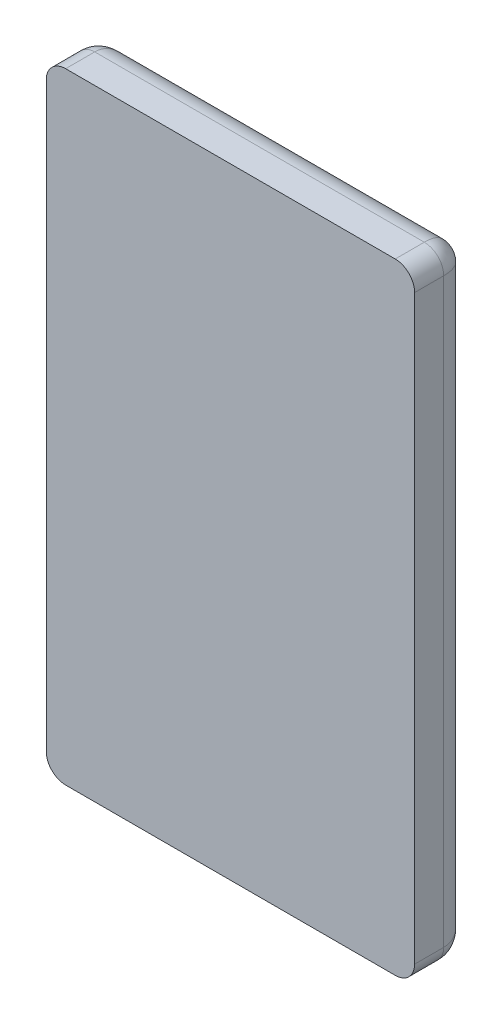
ISO-10303-21;
HEADER;
FILE_DESCRIPTION(('STEP AP214'),'2;1');
FILE_NAME('part.step','',(''),(''),'','','');
FILE_SCHEMA(('AUTOMOTIVE_DESIGN { 1 0 10303 214 1 1 1 1 }'));
ENDSEC;
DATA;
#1=APPLICATION_CONTEXT('core data for automotive mechanical design processes');
#2=APPLICATION_PROTOCOL_DEFINITION('international standard','automotive_design',2000,#1);
#3=PRODUCT_CONTEXT('',#1,'mechanical');
#4=PRODUCT('Part','Part','',(#3));
#5=PRODUCT_RELATED_PRODUCT_CATEGORY('part','',(#4));
#6=PRODUCT_DEFINITION_FORMATION('','',#4);
#7=PRODUCT_DEFINITION_CONTEXT('part definition',#1,'design');
#8=PRODUCT_DEFINITION('design','',#6,#7);
#9=PRODUCT_DEFINITION_SHAPE('','',#8);
#10=(LENGTH_UNIT() NAMED_UNIT(*) SI_UNIT(.MILLI.,.METRE.));
#11=(NAMED_UNIT(*) PLANE_ANGLE_UNIT() SI_UNIT($,.RADIAN.));
#12=(NAMED_UNIT(*) SI_UNIT($,.STERADIAN.) SOLID_ANGLE_UNIT());
#13=UNCERTAINTY_MEASURE_WITH_UNIT(LENGTH_MEASURE(1.E-05),#10,'distance_accuracy_value','');
#14=(GEOMETRIC_REPRESENTATION_CONTEXT(3) GLOBAL_UNCERTAINTY_ASSIGNED_CONTEXT((#13)) GLOBAL_UNIT_ASSIGNED_CONTEXT((#10,
#11,#12)) REPRESENTATION_CONTEXT('',''));
#15=CARTESIAN_POINT('',(0.,0.,0.));
#16=DIRECTION('',(0.,0.,1.));
#17=DIRECTION('',(1.,0.,0.));
#18=AXIS2_PLACEMENT_3D('',#15,#16,#17);
#19=CARTESIAN_POINT('',(8.5,-9.5,1.5));
#20=CARTESIAN_POINT('',(8.64959965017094,-9.5,1.5));
#21=CARTESIAN_POINT('',(8.87382526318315,-9.44864904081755,1.5));
#22=CARTESIAN_POINT('',(9.12869530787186,-9.28832458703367,1.5));
#23=CARTESIAN_POINT('',(9.31506766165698,-9.10215615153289,1.5));
#24=CARTESIAN_POINT('',(9.46187561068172,-8.83656565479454,1.5));
#25=CARTESIAN_POINT('',(9.50000000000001,-8.6121997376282,1.5));
#26=CARTESIAN_POINT('',(9.50000000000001,-8.5,1.5));
#27=CARTESIAN_POINT('',(8.5,-9.5,1.38780026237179));
#28=CARTESIAN_POINT('',(8.64959965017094,-9.5,1.37658483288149));
#29=CARTESIAN_POINT('',(8.87382526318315,-9.44864904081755,1.36367698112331));
#30=CARTESIAN_POINT('',(9.12869530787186,-9.28832458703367,1.3565996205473));
#31=CARTESIAN_POINT('',(9.31506766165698,-9.10215615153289,1.35658888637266));
#32=CARTESIAN_POINT('',(9.46187561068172,-8.83656565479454,1.36547403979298));
#33=CARTESIAN_POINT('',(9.50000000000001,-8.6121997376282,1.37940636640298));
#34=CARTESIAN_POINT('',(9.50000000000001,-8.5,1.38780026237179));
#35=CARTESIAN_POINT('',(8.49366801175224,-9.48100403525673,1.219516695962));
#36=CARTESIAN_POINT('',(8.6388147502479,-9.47700964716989,1.19182516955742));
#37=CARTESIAN_POINT('',(8.85636499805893,-9.42202768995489,1.15995669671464));
#38=CARTESIAN_POINT('',(9.10512795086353,-9.26212177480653,1.14250401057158));
#39=CARTESIAN_POINT('',(9.2884055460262,-9.07902138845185,1.14247480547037));
#40=CARTESIAN_POINT('',(9.43561422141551,-8.82020764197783,1.16438848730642));
#41=CARTESIAN_POINT('',(9.47798355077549,-8.60252182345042,1.1987785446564));
#42=CARTESIAN_POINT('',(9.48100403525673,-8.49366801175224,1.219516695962));
#43=CARTESIAN_POINT('',(8.46256992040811,-9.38770976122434,0.89558329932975));
#44=CARTESIAN_POINT('',(8.5887497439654,-9.36823355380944,0.846192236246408));
#45=CARTESIAN_POINT('',(8.77794669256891,-9.30051728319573,0.789943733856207));
#46=CARTESIAN_POINT('',(8.99993684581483,-9.14456836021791,0.759252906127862));
#47=CARTESIAN_POINT('',(9.16876183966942,-8.97586837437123,0.759209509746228));
#48=CARTESIAN_POINT('',(9.31525418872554,-8.74647253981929,0.797720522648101));
#49=CARTESIAN_POINT('',(9.37313353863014,-8.55721461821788,0.858591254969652));
#50=CARTESIAN_POINT('',(9.38770976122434,-8.46256992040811,0.895583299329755));
#51=CARTESIAN_POINT('',(8.3892696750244,-9.1678090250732,0.496973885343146));
#52=CARTESIAN_POINT('',(8.47893183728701,-9.12355973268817,0.445961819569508));
#53=CARTESIAN_POINT('',(8.61344962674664,-9.03896445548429,0.389505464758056));
#54=CARTESIAN_POINT('',(8.78106304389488,-8.89807581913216,0.359042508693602));
#55=CARTESIAN_POINT('',(8.91760958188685,-8.76156685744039,0.359017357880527));
#56=CARTESIAN_POINT('',(9.05465555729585,-8.59103537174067,0.397178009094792));
#57=CARTESIAN_POINT('',(9.13468435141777,-8.45653365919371,0.458736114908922));
#58=CARTESIAN_POINT('',(9.16780902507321,-8.3892696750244,0.49697388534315));
#59=CARTESIAN_POINT('',(8.22436773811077,-8.67310321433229,0.102430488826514));
#60=CARTESIAN_POINT('',(8.26697111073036,-8.63020086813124,0.088458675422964));
#61=CARTESIAN_POINT('',(8.33090170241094,-8.56596506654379,0.073741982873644));
#62=CARTESIAN_POINT('',(8.41626243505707,-8.48035757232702,0.065959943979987));
#63=CARTESIAN_POINT('',(8.49105269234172,-8.4055797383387,0.065961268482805));
#64=CARTESIAN_POINT('',(8.57668270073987,-8.3202442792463,0.075679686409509));
#65=CARTESIAN_POINT('',(8.64097371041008,-8.25633195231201,0.091937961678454));
#66=CARTESIAN_POINT('',(8.67310321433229,-8.22436773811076,0.102430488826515));
#67=CARTESIAN_POINT('',(8.07479982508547,-8.2243994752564,0.));
#68=CARTESIAN_POINT('',(8.08904741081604,-8.21015188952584,0.));
#69=CARTESIAN_POINT('',(8.11041878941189,-8.18878051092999,0.));
#70=CARTESIAN_POINT('',(8.13891396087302,-8.16028533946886,0.));
#71=CARTESIAN_POINT('',(8.16384723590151,-8.13535206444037,0.));
#72=CARTESIAN_POINT('',(8.19234240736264,-8.10685689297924,0.));
#73=CARTESIAN_POINT('',(8.21371378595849,-8.08548551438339,0.));
#74=CARTESIAN_POINT('',(8.22439947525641,-8.07479982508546,0.));
#75=CARTESIAN_POINT('',(8.,-7.99999999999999,0.));
#76=CARTESIAN_POINT('',(8.,-7.99999999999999,0.));
#77=CARTESIAN_POINT('',(8.,-7.99999999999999,0.));
#78=CARTESIAN_POINT('',(8.,-7.99999999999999,0.));
#79=CARTESIAN_POINT('',(8.,-7.99999999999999,0.));
#80=CARTESIAN_POINT('',(8.,-7.99999999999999,0.));
#81=CARTESIAN_POINT('',(8.,-7.99999999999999,0.));
#82=CARTESIAN_POINT('',(8.,-7.99999999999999,0.));
#83=B_SPLINE_SURFACE_WITH_KNOTS('',3,3,((#19,#20,#21,#22,#23,#24,#25,#26),(#27,#28,#29,#30,#31,
#32,#33,#34),(#35,#36,#37,#38,#39,#40,#41,#42),(#43,#44,#45,#46,#47,#48,#49,#50),(#51,#52,#53,
#54,#55,#56,#57,#58),(#59,#60,#61,#62,#63,#64,#65,#66),(#67,#68,#69,#70,#71,#72,#73,#74),(#75,
#76,#77,#78,#79,#80,#81,#82)),.UNSPECIFIED.,.F.,.F.,.F.,(4,1,1,1,1,4),(4,1,1,1,1,4),(0.,
0.224399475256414,0.336599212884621,0.673198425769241,1.12199737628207,1.5707963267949),(0.,
0.285714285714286,0.428571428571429,0.571428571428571,0.785714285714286,1.),.UNSPECIFIED.);
#84=CARTESIAN_POINT('',(8.,-7.99999999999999,0.));
#85=CARTESIAN_POINT('',(8.22439947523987,-8.07479982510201,0.));
#86=CARTESIAN_POINT('',(8.67310321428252,-8.22436773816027,0.102430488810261));
#87=CARTESIAN_POINT('',(9.1678090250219,-8.38926967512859,0.496973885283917));
#88=CARTESIAN_POINT('',(9.38770976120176,-8.46256992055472,0.895583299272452));
#89=CARTESIAN_POINT('',(9.48100403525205,-8.49366801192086,1.21951669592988));
#90=CARTESIAN_POINT('',(9.50000000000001,-8.5000000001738,1.38780026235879));
#91=CARTESIAN_POINT('',(9.50000000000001,-8.5000000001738,1.5));
#92=B_SPLINE_CURVE_WITH_KNOTS('',3,(#84,#85,#86,#87,#88,#89,#90,#91),.UNSPECIFIED.,.F.,.F.,(4,1,
1,1,1,4),(0.,0.448798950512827,0.897597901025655,1.23419711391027,1.34639685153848,
1.5707963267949),.UNSPECIFIED.);
#93=CARTESIAN_POINT('',(9.50000000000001,-8.50000000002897,1.5));
#94=VERTEX_POINT('',#93);
#95=CARTESIAN_POINT('',(8.,-8.,0.));
#96=VERTEX_POINT('',#95);
#97=EDGE_CURVE('E113',#94,#96,#92,.F.);
#98=CARTESIAN_POINT('',(9.50000000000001,-8.5,1.5));
#99=CARTESIAN_POINT('',(9.50000000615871,-8.5130898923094,1.5));
#100=CARTESIAN_POINT('',(9.49974054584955,-8.52617966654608,1.5));
#101=CARTESIAN_POINT('',(9.4987060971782,-8.55233882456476,1.5));
#102=CARTESIAN_POINT('',(9.49793110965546,-8.56540820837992,1.5));
#103=CARTESIAN_POINT('',(9.49586900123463,-8.59150660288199,1.5));
#104=CARTESIAN_POINT('',(9.49458187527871,-8.60453561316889,1.5));
#105=CARTESIAN_POINT('',(9.4914988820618,-8.63053336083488,1.5));
#106=CARTESIAN_POINT('',(9.48970301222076,-8.64350209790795,1.5));
#107=CARTESIAN_POINT('',(9.48560590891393,-8.66935937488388,1.5));
#108=CARTESIAN_POINT('',(9.48330467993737,-8.68224791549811,1.5));
#109=CARTESIAN_POINT('',(9.47820024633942,-8.70792488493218,1.5));
#110=CARTESIAN_POINT('',(9.47539705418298,-8.72071331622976,1.5));
#111=CARTESIAN_POINT('',(9.4692920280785,-8.74617013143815,1.5));
#112=CARTESIAN_POINT('',(9.46599021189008,-8.75883851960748,1.5));
#113=CARTESIAN_POINT('',(9.45889147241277,-8.7840353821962,1.5));
#114=CARTESIAN_POINT('',(9.45509456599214,-8.79656386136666,1.5));
#115=CARTESIAN_POINT('',(9.4470084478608,-8.82146078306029,1.5));
#116=CARTESIAN_POINT('',(9.44271924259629,-8.83382922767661,1.5));
#117=CARTESIAN_POINT('',(9.43365465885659,-8.85838694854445,1.5));
#118=CARTESIAN_POINT('',(9.42887926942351,-8.87057622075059,1.5));
#119=CARTESIAN_POINT('',(9.41885287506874,-8.89475808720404,1.5));
#120=CARTESIAN_POINT('',(9.41360185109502,-8.90675067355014,1.5));
#121=CARTESIAN_POINT('',(9.40263385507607,-8.93052136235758,1.5));
#122=CARTESIAN_POINT('',(9.39691686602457,-8.94229945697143,1.5));
#123=CARTESIAN_POINT('',(9.38502683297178,-8.9656234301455,1.5));
#124=CARTESIAN_POINT('',(9.37885378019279,-8.9771693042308,1.5));
#125=CARTESIAN_POINT('',(9.36606144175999,-9.0000110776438,1.5));
#126=CARTESIAN_POINT('',(9.3594421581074,-9.01130697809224,1.5));
#127=CARTESIAN_POINT('',(9.34576720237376,-9.03363105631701,1.5));
#128=CARTESIAN_POINT('',(9.33871154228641,-9.04465924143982,1.5));
#129=CARTESIAN_POINT('',(9.32417364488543,-9.06643011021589,1.5));
#130=CARTESIAN_POINT('',(9.3166914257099,-9.07717280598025,1.5));
#131=CARTESIAN_POINT('',(9.3013103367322,-9.09835502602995,1.5));
#132=CARTESIAN_POINT('',(9.29341148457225,-9.10879456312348,1.5));
#133=CARTESIAN_POINT('',(9.27720664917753,-9.12935240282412,1.5));
#134=CARTESIAN_POINT('',(9.2689006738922,-9.13947071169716,1.5));
#135=CARTESIAN_POINT('',(9.25189595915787,-9.15937193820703,1.5));
#136=CARTESIAN_POINT('',(9.24319721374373,-9.16915485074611,1.5));
#137=CARTESIAN_POINT('',(9.22542194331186,-9.18837180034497,1.5));
#138=CARTESIAN_POINT('',(9.21634540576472,-9.19780582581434,1.5));
#139=CARTESIAN_POINT('',(9.19782934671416,-9.21631134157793,1.5));
#140=CARTESIAN_POINT('',(9.18838981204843,-9.22538281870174,1.5));
#141=CARTESIAN_POINT('',(9.16916261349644,-9.24314963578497,1.5));
#142=CARTESIAN_POINT('',(9.15937493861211,-9.25184496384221,1.5));
#143=CARTESIAN_POINT('',(9.13946623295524,-9.26884579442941,1.5));
#144=CARTESIAN_POINT('',(9.12934519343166,-9.27715128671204,1.5));
#145=CARTESIAN_POINT('',(9.10878486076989,-9.29335897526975,1.5));
#146=CARTESIAN_POINT('',(9.09834556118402,-9.30126116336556,1.5));
#147=CARTESIAN_POINT('',(9.07716550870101,-9.31665060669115,1.5));
#148=CARTESIAN_POINT('',(9.0664247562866,-9.32413786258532,1.5));
#149=CARTESIAN_POINT('',(9.04465846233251,-9.33868562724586,1.5));
#150=CARTESIAN_POINT('',(9.03363292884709,-9.34574614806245,1.5));
#151=CARTESIAN_POINT('',(9.01131375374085,-9.35942861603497,1.5));
#152=CARTESIAN_POINT('',(9.00002012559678,-9.36605058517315,1.5));
#153=CARTESIAN_POINT('',(8.97718153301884,-9.37884431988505,1.5));
#154=CARTESIAN_POINT('',(8.96563658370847,-9.38501611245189,1.5));
#155=CARTESIAN_POINT('',(8.942311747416,-9.39689710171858,1.5));
#156=CARTESIAN_POINT('',(8.930531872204,-9.40260632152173,1.5));
#157=CARTESIAN_POINT('',(8.90675517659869,-9.41355322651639,1.5));
#158=CARTESIAN_POINT('',(8.89475835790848,-9.41879091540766,1.5));
#159=CARTESIAN_POINT('',(8.87056768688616,-9.42879065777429,1.5));
#160=CARTESIAN_POINT('',(8.8583738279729,-9.43355269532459,1.5));
#161=CARTESIAN_POINT('',(8.83380851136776,-9.44259612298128,1.5));
#162=CARTESIAN_POINT('',(8.82143704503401,-9.44687748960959,1.5));
#163=CARTESIAN_POINT('',(8.79653606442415,-9.45495479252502,1.5));
#164=CARTESIAN_POINT('',(8.78400654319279,-9.45875070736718,1.5));
#165=CARTESIAN_POINT('',(8.75880896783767,-9.4658522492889,1.5));
#166=CARTESIAN_POINT('',(8.74614091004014,-9.46915786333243,1.5));
#167=CARTESIAN_POINT('',(8.72068578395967,-9.47527395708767,1.5));
#168=CARTESIAN_POINT('',(8.70789871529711,-9.47808443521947,1.5));
#169=CARTESIAN_POINT('',(8.68222508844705,-9.48320540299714,1.5));
#170=CARTESIAN_POINT('',(8.66933853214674,-9.48551590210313,1.5));
#171=CARTESIAN_POINT('',(8.64348545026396,-9.48963205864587,1.5));
#172=CARTESIAN_POINT('',(8.63051892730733,-9.49143773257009,1.5));
#173=CARTESIAN_POINT('',(8.60452544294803,-9.49453939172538,1.5));
#174=CARTESIAN_POINT('',(8.59149848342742,-9.49583539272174,1.5));
#175=CARTESIAN_POINT('',(8.56540362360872,-9.49791285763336,1.5));
#176=CARTESIAN_POINT('',(8.55233572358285,-9.49869432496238,1.5));
#177=CARTESIAN_POINT('',(8.52617860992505,-9.49973792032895,1.5));
#178=CARTESIAN_POINT('',(8.51308939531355,-9.50000002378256,1.5));
#179=CARTESIAN_POINT('',(8.5,-9.5,1.5));
#180=B_SPLINE_CURVE_WITH_KNOTS('',3,(#98,#99,#100,#101,#102,#103,#104,#105,#106,#107,#108,#109,
#110,#111,#112,#113,#114,#115,#116,#117,#118,#119,#120,#121,#122,#123,#124,#125,#126,#127,#128,
#129,#130,#131,#132,#133,#134,#135,#136,#137,#138,#139,#140,#141,#142,#143,#144,#145,#146,#147,
#148,#149,#150,#151,#152,#153,#154,#155,#156,#157,#158,#159,#160,#161,#162,#163,#164,#165,#166,
#167,#168,#169,#170,#171,#172,#173,#174,#175,#176,#177,#178,#179),.UNSPECIFIED.,.F.,.F.,(4,2,2,
2,2,2,2,2,2,2,2,2,2,2,2,2,2,2,2,2,2,2,2,2,2,2,2,2,2,2,2,2,2,2,2,2,2,2,2,2,4),(0.,
0.0392669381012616,0.0785338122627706,0.117801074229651,0.157068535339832,0.196335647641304,
0.235601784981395,0.274866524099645,0.314129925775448,0.353392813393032,0.392656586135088,
0.431921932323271,0.471188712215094,0.510456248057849,0.549723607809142,0.58898988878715,
0.628254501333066,0.66751745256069,0.706779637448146,0.746042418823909,0.78530650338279,
0.824572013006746,0.863838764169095,0.903106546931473,0.942375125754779,0.981643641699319,
1.02091104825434,1.06017648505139,1.09943956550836,1.13870068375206,1.17796149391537,
1.217223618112,1.25648765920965,1.29575343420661,1.33502025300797,1.37428719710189,
1.41355339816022,1.45281831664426,1.49208202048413,1.5313454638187,1.57061076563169),.UNSPECIFIED.);
#181=CARTESIAN_POINT('',(8.5,-9.5,1.5));
#182=VERTEX_POINT('',#181);
#183=EDGE_CURVE('E96',#94,#182,#180,.T.);
#184=CARTESIAN_POINT('',(8.5,-9.5,1.5));
#185=CARTESIAN_POINT('',(8.50000003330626,-9.50000009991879,1.48036462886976));
#186=CARTESIAN_POINT('',(8.49987071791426,-9.4996121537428,1.46072942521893));
#187=CARTESIAN_POINT('',(8.49935491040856,-9.49806473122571,1.42148964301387));
#188=CARTESIAN_POINT('',(8.49896837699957,-9.49690513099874,1.40188506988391));
#189=CARTESIAN_POINT('',(8.49793948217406,-9.49381844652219,1.36273658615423));
#190=CARTESIAN_POINT('',(8.49729703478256,-9.4918911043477,1.34319269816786));
#191=CARTESIAN_POINT('',(8.49575769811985,-9.48727309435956,1.3041954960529));
#192=CARTESIAN_POINT('',(8.49486068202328,-9.48458204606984,1.28474223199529));
#193=CARTESIAN_POINT('',(8.49281360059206,-9.47844080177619,1.24595619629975));
#194=CARTESIAN_POINT('',(8.49166336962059,-9.47499010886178,1.22662351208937));
#195=CARTESIAN_POINT('',(8.48911116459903,-9.4673334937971,1.1881085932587));
#196=CARTESIAN_POINT('',(8.48770898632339,-9.46312695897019,1.16892649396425));
#197=CARTESIAN_POINT('',(8.48465455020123,-9.45396365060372,1.13074249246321));
#198=CARTESIAN_POINT('',(8.48300204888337,-9.44900614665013,1.11174078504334));
#199=CARTESIAN_POINT('',(8.47944968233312,-9.43834904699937,1.07394640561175));
#200=CARTESIAN_POINT('',(8.47754953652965,-9.43264860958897,1.05515399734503));
#201=CARTESIAN_POINT('',(8.47350420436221,-9.42051261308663,1.01780741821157));
#202=CARTESIAN_POINT('',(8.47135870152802,-9.41407610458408,0.999253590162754));
#203=CARTESIAN_POINT('',(8.4668261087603,-9.40047832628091,0.962412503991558));
#204=CARTESIAN_POINT('',(8.46443867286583,-9.3933160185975,0.944125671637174));
#205=CARTESIAN_POINT('',(8.45942708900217,-9.37828126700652,0.907845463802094));
#206=CARTESIAN_POINT('',(8.45680257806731,-9.37040773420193,0.889852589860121));
#207=CARTESIAN_POINT('',(8.45132143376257,-9.3539643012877,0.854187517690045));
#208=CARTESIAN_POINT('',(8.44846442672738,-9.34539328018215,0.836515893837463));
#209=CARTESIAN_POINT('',(8.4425229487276,-9.32756884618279,0.801520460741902));
#210=CARTESIAN_POINT('',(8.43943809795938,-9.31831429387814,0.784197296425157));
#211=CARTESIAN_POINT('',(8.43304556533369,-9.29913669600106,0.749925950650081));
#212=CARTESIAN_POINT('',(8.42973750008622,-9.28921250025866,0.732978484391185));
#213=CARTESIAN_POINT('',(8.42290317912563,-9.26870953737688,0.699485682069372));
#214=CARTESIAN_POINT('',(8.41937653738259,-9.25812961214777,0.682941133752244));
#215=CARTESIAN_POINT('',(8.41210968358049,-9.23632905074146,0.65028137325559));
#216=CARTESIAN_POINT('',(8.4083690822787,-9.22510724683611,0.634167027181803));
#217=CARTESIAN_POINT('',(8.40067899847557,-9.20203699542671,0.602394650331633));
#218=CARTESIAN_POINT('',(8.39672912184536,-9.19018736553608,0.586737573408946));
#219=CARTESIAN_POINT('',(8.38862493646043,-9.16587480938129,0.555907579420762));
#220=CARTESIAN_POINT('',(8.38447022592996,-9.15341067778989,0.540735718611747));
#221=CARTESIAN_POINT('',(8.3759639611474,-9.12789188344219,0.510896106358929));
#222=CARTESIAN_POINT('',(8.37161200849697,-9.1148360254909,0.496229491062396));
#223=CARTESIAN_POINT('',(8.36271925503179,-9.08815776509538,0.467419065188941));
#224=CARTESIAN_POINT('',(8.35817806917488,-9.07453420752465,0.453276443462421));
#225=CARTESIAN_POINT('',(8.34891472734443,-9.0467441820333,0.425533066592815));
#226=CARTESIAN_POINT('',(8.34419220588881,-9.03257661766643,0.411933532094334));
#227=CARTESIAN_POINT('',(8.33457409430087,-9.00372228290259,0.385295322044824));
#228=CARTESIAN_POINT('',(8.32967816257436,-8.98903448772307,0.372257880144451));
#229=CARTESIAN_POINT('',(8.319721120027,-8.95916336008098,0.346762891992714));
#230=CARTESIAN_POINT('',(8.31465969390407,-8.94397908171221,0.334306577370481));
#231=CARTESIAN_POINT('',(8.30437955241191,-8.91313865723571,0.309992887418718));
#232=CARTESIAN_POINT('',(8.29916054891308,-8.89748164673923,0.298136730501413));
#233=CARTESIAN_POINT('',(8.28857314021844,-8.86571942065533,0.275042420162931));
#234=CARTESIAN_POINT('',(8.28320447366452,-8.84961342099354,0.263805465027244));
#235=CARTESIAN_POINT('',(8.27232563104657,-8.81697689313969,0.241968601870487));
#236=CARTESIAN_POINT('',(8.26681521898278,-8.80044565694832,0.23136986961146));
#237=CARTESIAN_POINT('',(8.25566076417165,-8.76698229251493,0.210828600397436));
#238=CARTESIAN_POINT('',(8.25001650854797,-8.7500495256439,0.200887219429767));
#239=CARTESIAN_POINT('',(8.23860230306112,-8.71580690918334,0.181679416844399));
#240=CARTESIAN_POINT('',(8.23283216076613,-8.69849648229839,0.172414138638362));
#241=CARTESIAN_POINT('',(8.22117391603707,-8.66352174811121,0.154578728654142));
#242=CARTESIAN_POINT('',(8.21528563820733,-8.64585691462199,0.146009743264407));
#243=CARTESIAN_POINT('',(8.20339992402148,-8.61019977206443,0.129580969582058));
#244=CARTESIAN_POINT('',(8.19740233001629,-8.59220699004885,0.121722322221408));
#245=CARTESIAN_POINT('',(8.18530805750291,-8.55592417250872,0.106719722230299));
#246=CARTESIAN_POINT('',(8.17921124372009,-8.53763373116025,0.0995768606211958));
#247=CARTESIAN_POINT('',(8.16692835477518,-8.50078506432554,0.0860130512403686));
#248=CARTESIAN_POINT('',(8.16074216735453,-8.4822265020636,0.0795931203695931));
#249=CARTESIAN_POINT('',(8.14829042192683,-8.44487126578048,0.0674819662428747));
#250=CARTESIAN_POINT('',(8.14202477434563,-8.42607432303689,0.061791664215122));
#251=CARTESIAN_POINT('',(8.12942398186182,-8.38827194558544,0.0511467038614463));
#252=CARTESIAN_POINT('',(8.12308876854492,-8.36926630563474,0.0461928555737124));
#253=CARTESIAN_POINT('',(8.110358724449,-8.33107617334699,0.0370277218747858));
#254=CARTESIAN_POINT('',(8.1039638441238,-8.31189153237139,0.0328171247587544));
#255=CARTESIAN_POINT('',(8.09112434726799,-8.27337304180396,0.0251454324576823));
#256=CARTESIAN_POINT('',(8.08467969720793,-8.25403909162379,0.0216848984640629));
#257=CARTESIAN_POINT('',(8.07175054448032,-8.21525163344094,0.0155202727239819));
#258=CARTESIAN_POINT('',(8.06526602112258,-8.19579806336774,0.0128166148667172));
#259=CARTESIAN_POINT('',(8.05226701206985,-8.15680103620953,0.00817268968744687));
#260=CARTESIAN_POINT('',(8.04575251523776,-8.13725754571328,0.00623273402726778));
#261=CARTESIAN_POINT('',(8.03270343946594,-8.09811031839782,0.0031231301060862));
#262=CARTESIAN_POINT('',(8.02616885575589,-8.07850656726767,0.00195368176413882));
#263=CARTESIAN_POINT('',(8.01308953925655,-8.03926861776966,0.000392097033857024));
#264=CARTESIAN_POINT('',(8.00654480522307,-8.01963441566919,6.49709311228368E-08));
#265=CARTESIAN_POINT('',(8.,-7.99999999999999,0.));
#266=B_SPLINE_CURVE_WITH_KNOTS('',3,(#184,#185,#186,#187,#188,#189,#190,#191,#192,#193,#194,
#195,#196,#197,#198,#199,#200,#201,#202,#203,#204,#205,#206,#207,#208,#209,#210,#211,#212,#213,
#214,#215,#216,#217,#218,#219,#220,#221,#222,#223,#224,#225,#226,#227,#228,#229,#230,#231,#232,
#233,#234,#235,#236,#237,#238,#239,#240,#241,#242,#243,#244,#245,#246,#247,#248,#249,#250,#251,
#252,#253,#254,#255,#256,#257,#258,#259,#260,#261,#262,#263,#264,#265),.UNSPECIFIED.,.F.,.F.,(4,
2,2,2,2,2,2,2,2,2,2,2,2,2,2,2,2,2,2,2,2,2,2,2,2,2,2,2,2,2,2,2,2,2,2,2,2,2,2,2,4),(0.,
0.0589016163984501,0.11781269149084,0.176743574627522,0.235703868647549,0.294702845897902,
0.353749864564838,0.41285468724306,0.472027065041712,0.531276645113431,0.590612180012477,
0.650040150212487,0.709565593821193,0.769192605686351,0.828924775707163,0.888765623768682,
0.948719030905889,1.0087896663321,1.06898321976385,1.12930430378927,1.18975477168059,
1.25033423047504,1.31104050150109,1.37187007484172,1.43281855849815,1.49388112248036,
1.55505293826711,1.61632961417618,1.67770762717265,1.73918472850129,1.80075888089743,
1.86242550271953,1.92417781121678,1.98600733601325,2.0479043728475,2.10985843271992,
2.17185868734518,2.23389441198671,2.29595542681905,2.35803253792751,2.42011797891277),.UNSPECIFIED.);
#267=EDGE_CURVE('E117',#96,#182,#266,.F.);
#268=ORIENTED_EDGE('',*,*,#97,.F.);
#269=ORIENTED_EDGE('',*,*,#183,.T.);
#270=ORIENTED_EDGE('',*,*,#267,.F.);
#271=EDGE_LOOP('',(#268,#269,#270));
#272=FACE_BOUND('',#271,.T.);
#273=ADVANCED_FACE('F16',(#272),#83,.T.);
#274=CARTESIAN_POINT('',(9.5,21.5,1.5));
#275=CARTESIAN_POINT('',(9.5,21.6495996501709,1.5));
#276=CARTESIAN_POINT('',(9.4486455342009,21.8738214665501,1.5));
#277=CARTESIAN_POINT('',(9.28832748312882,22.1287026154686,1.5));
#278=CARTESIAN_POINT('',(9.10215322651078,22.3150646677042,1.5));
#279=CARTESIAN_POINT('',(8.83656581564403,22.4618772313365,1.5));
#280=CARTESIAN_POINT('',(8.61219973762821,22.5,1.5));
#281=CARTESIAN_POINT('',(8.5,22.5,1.5));
#282=CARTESIAN_POINT('',(9.5,21.5,1.38780026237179));
#283=CARTESIAN_POINT('',(9.5,21.6495996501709,1.3765841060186));
#284=CARTESIAN_POINT('',(9.4486455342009,21.8738214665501,1.36367785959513));
#285=CARTESIAN_POINT('',(9.28832748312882,22.1287026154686,1.35659921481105));
#286=CARTESIAN_POINT('',(9.10215322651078,22.3150646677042,1.3565890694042));
#287=CARTESIAN_POINT('',(8.83656581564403,22.4618772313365,1.36547389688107));
#288=CARTESIAN_POINT('',(8.61219973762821,22.5,1.37940644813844));
#289=CARTESIAN_POINT('',(8.5,22.5,1.38780026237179));
#290=CARTESIAN_POINT('',(9.47476072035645,21.4915869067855,1.163380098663));
#291=CARTESIAN_POINT('',(9.46929669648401,21.6351581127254,1.12990891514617));
#292=CARTESIAN_POINT('',(9.41296528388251,21.8503523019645,1.09140918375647));
#293=CARTESIAN_POINT('',(9.25311469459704,22.0970070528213,1.07031256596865));
#294=CARTESIAN_POINT('',(9.07103700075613,22.2792434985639,1.07028071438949));
#295=CARTESIAN_POINT('',(8.8145859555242,22.4266996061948,1.09676198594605));
#296=CARTESIAN_POINT('',(8.59926085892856,22.4706437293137,1.13832083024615));
#297=CARTESIAN_POINT('',(8.49158690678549,22.4747607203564,1.163380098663));
#298=CARTESIAN_POINT('',(9.36281472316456,21.4542715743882,0.843748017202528));
#299=CARTESIAN_POINT('',(9.33967416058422,21.5757474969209,0.793183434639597));
#300=CARTESIAN_POINT('',(9.2691248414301,21.7579074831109,0.735831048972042));
#301=CARTESIAN_POINT('',(9.1145041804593,21.9731253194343,0.704568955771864));
#302=CARTESIAN_POINT('',(8.94958719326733,22.1381455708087,0.704530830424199));
#303=CARTESIAN_POINT('',(8.72759901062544,22.28409095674,0.743741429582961));
#304=CARTESIAN_POINT('',(8.54539176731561,22.3455013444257,0.805880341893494));
#305=CARTESIAN_POINT('',(8.45427157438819,22.3628147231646,0.843748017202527));
#306=CARTESIAN_POINT('',(9.12276814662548,21.3742560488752,0.46113215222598));
#307=CARTESIAN_POINT('',(9.07868564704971,21.4596938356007,0.413727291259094));
#308=CARTESIAN_POINT('',(8.996067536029,21.5878836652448,0.36136893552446));
#309=CARTESIAN_POINT('',(8.86026237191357,21.7480706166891,0.33312831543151));
#310=CARTESIAN_POINT('',(8.72937415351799,21.8789945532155,0.333108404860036));
#311=CARTESIAN_POINT('',(8.56652382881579,22.0112894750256,0.368476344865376));
#312=CARTESIAN_POINT('',(8.43835563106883,22.0897821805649,0.425600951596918));
#313=CARTESIAN_POINT('',(8.37425604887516,22.1227681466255,0.46113215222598));
#314=CARTESIAN_POINT('',(8.67314741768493,21.2243824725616,0.102440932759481));
#315=CARTESIAN_POINT('',(8.63018395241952,21.2669351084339,0.088227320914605));
#316=CARTESIAN_POINT('',(8.56588323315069,21.3307975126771,0.073227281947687));
#317=CARTESIAN_POINT('',(8.48021816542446,21.4161207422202,0.065286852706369));
#318=CARTESIAN_POINT('',(8.40543559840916,21.4909156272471,0.065288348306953));
#319=CARTESIAN_POINT('',(8.32015056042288,21.5766129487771,0.075205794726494));
#320=CARTESIAN_POINT('',(8.25631179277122,21.6409824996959,0.09176926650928));
#321=CARTESIAN_POINT('',(8.22438247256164,21.6731474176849,0.102440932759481));
#322=CARTESIAN_POINT('',(8.22439947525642,21.0747998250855,0.));
#323=CARTESIAN_POINT('',(8.21015188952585,21.089047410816,0.));
#324=CARTESIAN_POINT('',(8.18878051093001,21.1104187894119,0.));
#325=CARTESIAN_POINT('',(8.16028533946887,21.138913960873,0.));
#326=CARTESIAN_POINT('',(8.13535206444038,21.1638472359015,0.));
#327=CARTESIAN_POINT('',(8.10685689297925,21.1923424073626,0.));
#328=CARTESIAN_POINT('',(8.0854855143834,21.2137137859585,0.));
#329=CARTESIAN_POINT('',(8.07479982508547,21.2243994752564,0.));
#330=CARTESIAN_POINT('',(8.,21.,0.));
#331=CARTESIAN_POINT('',(8.,21.,0.));
#332=CARTESIAN_POINT('',(8.,21.,0.));
#333=CARTESIAN_POINT('',(8.,21.,0.));
#334=CARTESIAN_POINT('',(8.,21.,0.));
#335=CARTESIAN_POINT('',(8.,21.,0.));
#336=CARTESIAN_POINT('',(8.,21.,0.));
#337=CARTESIAN_POINT('',(8.,21.,0.));
#338=B_SPLINE_SURFACE_WITH_KNOTS('',3,3,((#274,#275,#276,#277,#278,#279,#280,#281),(#282,#283,
#284,#285,#286,#287,#288,#289),(#290,#291,#292,#293,#294,#295,#296,#297),(#298,#299,#300,#301,
#302,#303,#304,#305),(#306,#307,#308,#309,#310,#311,#312,#313),(#314,#315,#316,#317,#318,#319,
#320,#321),(#322,#323,#324,#325,#326,#327,#328,#329),(#330,#331,#332,#333,#334,#335,#336,#337)),
.UNSPECIFIED.,.F.,.F.,.F.,(4,1,1,1,1,4),(4,1,1,1,1,4),(0.,0.224399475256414,0.448798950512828,
0.673198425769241,1.12199737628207,1.5707963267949),(0.,0.285714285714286,0.428571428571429,
0.571428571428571,0.785714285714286,1.),.UNSPECIFIED.);
#339=CARTESIAN_POINT('',(8.,21.,0.));
#340=CARTESIAN_POINT('',(8.07479982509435,21.2243994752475,0.));
#341=CARTESIAN_POINT('',(8.22438247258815,21.6731474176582,0.102440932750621));
#342=CARTESIAN_POINT('',(8.37425604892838,22.1227681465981,0.46113215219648));
#343=CARTESIAN_POINT('',(8.45427157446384,22.3628147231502,0.843748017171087));
#344=CARTESIAN_POINT('',(8.49158690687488,22.474760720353,1.16338009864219));
#345=CARTESIAN_POINT('',(8.50000000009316,22.5,1.38780026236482));
#346=CARTESIAN_POINT('',(8.50000000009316,22.5,1.5));
#347=B_SPLINE_CURVE_WITH_KNOTS('',3,(#339,#340,#341,#342,#343,#344,#345,#346),.UNSPECIFIED.,.F.,
.F.,(4,1,1,1,1,4),(0.,0.448798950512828,0.897597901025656,1.12199737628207,1.34639685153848,
1.5707963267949),.UNSPECIFIED.);
#348=CARTESIAN_POINT('',(8.50000000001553,22.5,1.5));
#349=VERTEX_POINT('',#348);
#350=CARTESIAN_POINT('',(8.,21.,0.));
#351=VERTEX_POINT('',#350);
#352=EDGE_CURVE('E232',#349,#351,#347,.F.);
#353=CARTESIAN_POINT('',(8.5,22.5,1.5));
#354=CARTESIAN_POINT('',(8.61219973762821,22.5,1.5));
#355=CARTESIAN_POINT('',(8.83656581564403,22.4618772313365,1.5));
#356=CARTESIAN_POINT('',(9.10215322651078,22.3150646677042,1.5));
#357=CARTESIAN_POINT('',(9.28832748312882,22.1287026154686,1.5));
#358=CARTESIAN_POINT('',(9.4486455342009,21.8738214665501,1.5));
#359=CARTESIAN_POINT('',(9.5,21.6495996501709,1.5));
#360=CARTESIAN_POINT('',(9.5,21.5,1.5));
#361=B_SPLINE_CURVE_WITH_KNOTS('',3,(#353,#354,#355,#356,#357,#358,#359,#360),.UNSPECIFIED.,.F.,
.F.,(4,1,1,1,1,4),(0.,0.214285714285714,0.428571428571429,0.571428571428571,0.714285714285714,
1.),.UNSPECIFIED.);
#362=CARTESIAN_POINT('',(9.5,21.5,1.5));
#363=VERTEX_POINT('',#362);
#364=EDGE_CURVE('E109',#349,#363,#361,.T.);
#365=CARTESIAN_POINT('',(9.50000000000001,21.5,1.5));
#366=CARTESIAN_POINT('',(9.50000000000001,21.5,1.38780026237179));
#367=CARTESIAN_POINT('',(9.47476072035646,21.4915869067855,1.163380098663));
#368=CARTESIAN_POINT('',(9.36281472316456,21.4542715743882,0.843748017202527));
#369=CARTESIAN_POINT('',(9.12276814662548,21.3742560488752,0.461132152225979));
#370=CARTESIAN_POINT('',(8.67314741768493,21.2243824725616,0.102440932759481));
#371=CARTESIAN_POINT('',(8.22439947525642,21.0747998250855,0.));
#372=CARTESIAN_POINT('',(8.,21.,0.));
#373=B_SPLINE_CURVE_WITH_KNOTS('',3,(#365,#366,#367,#368,#369,#370,#371,#372),.UNSPECIFIED.,.F.,
.F.,(4,1,1,1,1,4),(0.,0.224399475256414,0.448798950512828,0.673198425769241,1.12199737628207,
1.5707963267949),.UNSPECIFIED.);
#374=EDGE_CURVE('E124',#351,#363,#373,.F.);
#375=ORIENTED_EDGE('',*,*,#352,.F.);
#376=ORIENTED_EDGE('',*,*,#364,.T.);
#377=ORIENTED_EDGE('',*,*,#374,.F.);
#378=EDGE_LOOP('',(#375,#376,#377));
#379=FACE_BOUND('',#378,.T.);
#380=ADVANCED_FACE('F332',(#379),#338,.T.);
#381=CARTESIAN_POINT('',(-8.5,22.5,1.5));
#382=CARTESIAN_POINT('',(-8.64959965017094,22.5,1.5));
#383=CARTESIAN_POINT('',(-8.87382146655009,22.4486455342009,1.5));
#384=CARTESIAN_POINT('',(-9.12870261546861,22.2883274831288,1.5));
#385=CARTESIAN_POINT('',(-9.31506466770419,22.1021532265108,1.5));
#386=CARTESIAN_POINT('',(-9.46187723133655,21.836565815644,1.5));
#387=CARTESIAN_POINT('',(-9.5,21.6121997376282,1.5));
#388=CARTESIAN_POINT('',(-9.5,21.5,1.5));
#389=CARTESIAN_POINT('',(-8.5,22.5,1.38780026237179));
#390=CARTESIAN_POINT('',(-8.64959965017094,22.5,1.3765841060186));
#391=CARTESIAN_POINT('',(-8.87382146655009,22.4486455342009,1.36367785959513));
#392=CARTESIAN_POINT('',(-9.12870261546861,22.2883274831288,1.35659921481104));
#393=CARTESIAN_POINT('',(-9.31506466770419,22.1021532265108,1.3565890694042));
#394=CARTESIAN_POINT('',(-9.46187723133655,21.836565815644,1.36547389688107));
#395=CARTESIAN_POINT('',(-9.5,21.6121997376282,1.37940644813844));
#396=CARTESIAN_POINT('',(-9.5,21.5,1.38780026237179));
#397=CARTESIAN_POINT('',(-8.49158690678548,22.4747607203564,1.16338009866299));
#398=CARTESIAN_POINT('',(-8.63515811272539,22.469296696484,1.12990891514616));
#399=CARTESIAN_POINT('',(-8.85035230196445,22.4129652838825,1.09140918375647));
#400=CARTESIAN_POINT('',(-9.09700705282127,22.253114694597,1.07031256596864));
#401=CARTESIAN_POINT('',(-9.27924349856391,22.0710370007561,1.07028071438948));
#402=CARTESIAN_POINT('',(-9.42669960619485,21.8145859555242,1.09676198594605));
#403=CARTESIAN_POINT('',(-9.47064372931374,21.5992608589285,1.13832083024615));
#404=CARTESIAN_POINT('',(-9.47476072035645,21.4915869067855,1.163380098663));
#405=CARTESIAN_POINT('',(-8.45427157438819,22.3628147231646,0.843748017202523));
#406=CARTESIAN_POINT('',(-8.5757474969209,22.3396741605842,0.793183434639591));
#407=CARTESIAN_POINT('',(-8.75790748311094,22.2691248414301,0.735831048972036));
#408=CARTESIAN_POINT('',(-8.97312531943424,22.1145041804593,0.704568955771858));
#409=CARTESIAN_POINT('',(-9.13814557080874,21.9495871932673,0.704530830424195));
#410=CARTESIAN_POINT('',(-9.28409095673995,21.7275990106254,0.743741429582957));
#411=CARTESIAN_POINT('',(-9.34550134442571,21.5453917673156,0.805880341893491));
#412=CARTESIAN_POINT('',(-9.36281472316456,21.4542715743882,0.843748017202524));
#413=CARTESIAN_POINT('',(-8.37425604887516,22.1227681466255,0.461132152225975));
#414=CARTESIAN_POINT('',(-8.45969383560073,22.0786856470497,0.413727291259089));
#415=CARTESIAN_POINT('',(-8.58788366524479,21.996067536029,0.361368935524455));
#416=CARTESIAN_POINT('',(-8.74807061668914,21.8602623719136,0.333128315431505));
#417=CARTESIAN_POINT('',(-8.87899455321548,21.729374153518,0.333108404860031));
#418=CARTESIAN_POINT('',(-9.01128947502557,21.5665238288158,0.368476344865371));
#419=CARTESIAN_POINT('',(-9.08978218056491,21.4383556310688,0.425600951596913));
#420=CARTESIAN_POINT('',(-9.12276814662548,21.3742560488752,0.461132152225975));
#421=CARTESIAN_POINT('',(-8.22438247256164,21.6731474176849,0.102440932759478));
#422=CARTESIAN_POINT('',(-8.26693510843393,21.6301839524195,0.088227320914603));
#423=CARTESIAN_POINT('',(-8.33079751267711,21.5658832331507,0.073227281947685));
#424=CARTESIAN_POINT('',(-8.41612074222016,21.4802181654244,0.065286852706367));
#425=CARTESIAN_POINT('',(-8.49091562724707,21.4054355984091,0.06528834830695));
#426=CARTESIAN_POINT('',(-8.57661294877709,21.3201505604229,0.075205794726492));
#427=CARTESIAN_POINT('',(-8.64098249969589,21.2563117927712,0.091769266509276));
#428=CARTESIAN_POINT('',(-8.67314741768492,21.2243824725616,0.102440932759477));
#429=CARTESIAN_POINT('',(-8.07479982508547,21.2243994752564,0.));
#430=CARTESIAN_POINT('',(-8.08904741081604,21.2101518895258,0.));
#431=CARTESIAN_POINT('',(-8.11041878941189,21.18878051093,0.));
#432=CARTESIAN_POINT('',(-8.13891396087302,21.1602853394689,0.));
#433=CARTESIAN_POINT('',(-8.16384723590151,21.1353520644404,0.));
#434=CARTESIAN_POINT('',(-8.19234240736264,21.1068568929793,0.));
#435=CARTESIAN_POINT('',(-8.21371378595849,21.0854855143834,0.));
#436=CARTESIAN_POINT('',(-8.22439947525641,21.0747998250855,0.));
#437=CARTESIAN_POINT('',(-8.,21.,0.));
#438=CARTESIAN_POINT('',(-8.,21.,0.));
#439=CARTESIAN_POINT('',(-8.,21.,0.));
#440=CARTESIAN_POINT('',(-8.,21.,0.));
#441=CARTESIAN_POINT('',(-8.,21.,0.));
#442=CARTESIAN_POINT('',(-8.,21.,0.));
#443=CARTESIAN_POINT('',(-8.,21.,0.));
#444=CARTESIAN_POINT('',(-8.,21.,0.));
#445=B_SPLINE_SURFACE_WITH_KNOTS('',3,3,((#381,#382,#383,#384,#385,#386,#387,#388),(#389,#390,
#391,#392,#393,#394,#395,#396),(#397,#398,#399,#400,#401,#402,#403,#404),(#405,#406,#407,#408,
#409,#410,#411,#412),(#413,#414,#415,#416,#417,#418,#419,#420),(#421,#422,#423,#424,#425,#426,
#427,#428),(#429,#430,#431,#432,#433,#434,#435,#436),(#437,#438,#439,#440,#441,#442,#443,#444)),
.UNSPECIFIED.,.F.,.F.,.F.,(4,1,1,1,1,4),(4,1,1,1,1,4),(0.,0.224399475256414,0.448798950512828,
0.673198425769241,1.12199737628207,1.5707963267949),(0.,0.285714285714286,0.428571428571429,
0.571428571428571,0.785714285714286,1.),.UNSPECIFIED.);
#446=CARTESIAN_POINT('',(-8.,21.,0.));
#447=CARTESIAN_POINT('',(-8.22439947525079,21.0747998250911,0.));
#448=CARTESIAN_POINT('',(-8.67314741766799,21.2243824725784,0.102440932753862));
#449=CARTESIAN_POINT('',(-9.12276814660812,21.3742560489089,0.461132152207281));
#450=CARTESIAN_POINT('',(-9.36281472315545,21.4542715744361,0.843748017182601));
#451=CARTESIAN_POINT('',(-9.47476072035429,21.4915869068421,1.16338009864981));
#452=CARTESIAN_POINT('',(-9.5,21.500000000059,1.38780026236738));
#453=CARTESIAN_POINT('',(-9.5,21.500000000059,1.5));
#454=B_SPLINE_CURVE_WITH_KNOTS('',3,(#446,#447,#448,#449,#450,#451,#452,#453),.UNSPECIFIED.,.F.,
.F.,(4,1,1,1,1,4),(0.,0.448798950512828,0.897597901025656,1.12199737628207,1.34639685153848,
1.5707963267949),.UNSPECIFIED.);
#455=CARTESIAN_POINT('',(-9.5,21.5000000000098,1.5));
#456=VERTEX_POINT('',#455);
#457=CARTESIAN_POINT('',(-8.,21.,0.));
#458=VERTEX_POINT('',#457);
#459=EDGE_CURVE('E171',#456,#458,#454,.F.);
#460=CARTESIAN_POINT('',(-9.5,21.5,1.5));
#461=CARTESIAN_POINT('',(-9.5,21.6121997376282,1.5));
#462=CARTESIAN_POINT('',(-9.46187723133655,21.836565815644,1.5));
#463=CARTESIAN_POINT('',(-9.31506466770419,22.1021532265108,1.5));
#464=CARTESIAN_POINT('',(-9.12870261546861,22.2883274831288,1.5));
#465=CARTESIAN_POINT('',(-8.87382146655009,22.4486455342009,1.5));
#466=CARTESIAN_POINT('',(-8.64959965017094,22.5,1.5));
#467=CARTESIAN_POINT('',(-8.5,22.5,1.5));
#468=B_SPLINE_CURVE_WITH_KNOTS('',3,(#460,#461,#462,#463,#464,#465,#466,#467),.UNSPECIFIED.,.F.,
.F.,(4,1,1,1,1,4),(0.,0.214285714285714,0.428571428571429,0.571428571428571,0.714285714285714,
1.),.UNSPECIFIED.);
#469=CARTESIAN_POINT('',(-8.5,22.5,1.5));
#470=VERTEX_POINT('',#469);
#471=EDGE_CURVE('E360',#456,#470,#468,.T.);
#472=CARTESIAN_POINT('',(-8.5,22.5,1.5));
#473=CARTESIAN_POINT('',(-8.50000002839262,22.5000000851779,1.48036412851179));
#474=CARTESIAN_POINT('',(-8.49987116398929,22.4996134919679,1.46072837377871));
#475=CARTESIAN_POINT('',(-8.49935680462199,22.498070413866,1.42148669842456));
#476=CARTESIAN_POINT('',(-8.49897126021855,22.4969137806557,1.40188078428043));
#477=CARTESIAN_POINT('',(-8.49794452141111,22.4938335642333,1.36272929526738));
#478=CARTESIAN_POINT('',(-8.49730323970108,22.4919097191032,1.34318374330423));
#479=CARTESIAN_POINT('',(-8.49576603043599,22.487298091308,1.30418340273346));
#480=CARTESIAN_POINT('',(-8.49486997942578,22.4846099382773,1.28472866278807));
#481=CARTESIAN_POINT('',(-8.49282427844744,22.4784728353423,1.24594034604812));
#482=CARTESIAN_POINT('',(-8.49167446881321,22.4750234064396,1.22660685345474));
#483=CARTESIAN_POINT('',(-8.4891220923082,22.4673662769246,1.18809155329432));
#484=CARTESIAN_POINT('',(-8.487719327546,22.463157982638,1.16890987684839));
#485=CARTESIAN_POINT('',(-8.48466271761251,22.4539881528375,1.13072809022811));
#486=CARTESIAN_POINT('',(-8.48300863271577,22.4490258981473,1.11172817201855));
#487=CARTESIAN_POINT('',(-8.47945327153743,22.4383598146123,1.07393767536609));
#488=CARTESIAN_POINT('',(-8.47755171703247,22.4326551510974,1.05514735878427));
#489=CARTESIAN_POINT('',(-8.47350495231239,22.4205148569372,1.0178040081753));
#490=CARTESIAN_POINT('',(-8.47135943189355,22.4140782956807,0.999251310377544));
#491=CARTESIAN_POINT('',(-8.46682834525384,22.4004850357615,0.962411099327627));
#492=CARTESIAN_POINT('',(-8.46444244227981,22.3933273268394,0.944124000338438));
#493=CARTESIAN_POINT('',(-8.45943421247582,22.3783026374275,0.907842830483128));
#494=CARTESIAN_POINT('',(-8.4568115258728,22.3704345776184,0.889849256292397));
#495=CARTESIAN_POINT('',(-8.45133320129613,22.3539996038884,0.854183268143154));
#496=CARTESIAN_POINT('',(-8.44847718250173,22.3454315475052,0.836511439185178));
#497=CARTESIAN_POINT('',(-8.44253657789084,22.3276097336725,0.801516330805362));
#498=CARTESIAN_POINT('',(-8.43945159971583,22.3183547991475,0.784193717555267));
#499=CARTESIAN_POINT('',(-8.43305810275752,22.2991743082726,0.74992384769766));
#500=CARTESIAN_POINT('',(-8.42974918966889,22.2892475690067,0.732977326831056));
#501=CARTESIAN_POINT('',(-8.42291271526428,22.2687381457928,0.699486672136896));
#502=CARTESIAN_POINT('',(-8.41938475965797,22.2581542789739,0.682943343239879));
#503=CARTESIAN_POINT('',(-8.41211511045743,22.2363453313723,0.650286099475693));
#504=CARTESIAN_POINT('',(-8.40837302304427,22.2251190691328,0.634173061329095));
#505=CARTESIAN_POINT('',(-8.40068007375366,22.202040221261,0.602403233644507));
#506=CARTESIAN_POINT('',(-8.39672881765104,22.1901864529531,0.586747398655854));
#507=CARTESIAN_POINT('',(-8.38862226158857,22.1658667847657,0.555919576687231));
#508=CARTESIAN_POINT('',(-8.3844665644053,22.1533996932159,0.540748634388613));
#509=CARTESIAN_POINT('',(-8.37595870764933,22.127876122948,0.510910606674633));
#510=CARTESIAN_POINT('',(-8.37160615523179,22.1148184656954,0.496244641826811));
#511=CARTESIAN_POINT('',(-8.36271252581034,22.088137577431,0.467435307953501));
#512=CARTESIAN_POINT('',(-8.35817106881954,22.0745132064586,0.453293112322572));
#513=CARTESIAN_POINT('',(-8.34890745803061,22.0467223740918,0.425550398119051));
#514=CARTESIAN_POINT('',(-8.34418494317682,22.0325548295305,0.411951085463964));
#515=CARTESIAN_POINT('',(-8.33456706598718,22.0037011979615,0.385313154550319));
#516=CARTESIAN_POINT('',(-8.32967136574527,21.9890140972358,0.372275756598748));
#517=CARTESIAN_POINT('',(-8.31971495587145,21.9591448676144,0.346780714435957));
#518=CARTESIAN_POINT('',(-8.31465393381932,21.943961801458,0.334324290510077));
#519=CARTESIAN_POINT('',(-8.30437471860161,21.9131241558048,0.310010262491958));
#520=CARTESIAN_POINT('',(-8.29915623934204,21.8974687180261,0.298153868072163));
#521=CARTESIAN_POINT('',(-8.28856994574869,21.8657098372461,0.275058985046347));
#522=CARTESIAN_POINT('',(-8.2832018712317,21.8496056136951,0.263821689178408));
#523=CARTESIAN_POINT('',(-8.27232422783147,21.8169726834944,0.241984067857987));
#524=CARTESIAN_POINT('',(-8.26681442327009,21.8004432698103,0.231384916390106));
#525=CARTESIAN_POINT('',(-8.25566114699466,21.766983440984,0.210842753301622));
#526=CARTESIAN_POINT('',(-8.25001746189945,21.7500523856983,0.200900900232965));
#527=CARTESIAN_POINT('',(-8.23860430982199,21.715812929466,0.181692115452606));
#528=CARTESIAN_POINT('',(-8.2328346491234,21.6985039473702,0.172426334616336));
#529=CARTESIAN_POINT('',(-8.22117722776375,21.6635316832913,0.154589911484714));
#530=CARTESIAN_POINT('',(-8.21528928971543,21.6458678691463,0.146020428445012));
#531=CARTESIAN_POINT('',(-8.20340409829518,21.6102122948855,0.129590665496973));
#532=CARTESIAN_POINT('',(-8.19740668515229,21.5922200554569,0.1217315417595));
#533=CARTESIAN_POINT('',(-8.18531264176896,21.5559379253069,0.106727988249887));
#534=CARTESIAN_POINT('',(-8.17921587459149,21.5376476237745,0.0995846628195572));
#535=CARTESIAN_POINT('',(-8.16693297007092,21.5007989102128,0.086019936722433));
#536=CARTESIAN_POINT('',(-8.16074671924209,21.4822401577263,0.0795995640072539));
#537=CARTESIAN_POINT('',(-8.14829476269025,21.4448842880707,0.0674875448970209));
#538=CARTESIAN_POINT('',(-8.14202896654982,21.4260868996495,0.0617968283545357));
#539=CARTESIAN_POINT('',(-8.12942781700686,21.3882834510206,0.0511510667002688));
#540=CARTESIAN_POINT('',(-8.12309239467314,21.3692771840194,0.0461968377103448));
#541=CARTESIAN_POINT('',(-8.11036189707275,21.3310856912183,0.0370309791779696));
#542=CARTESIAN_POINT('',(-8.10396677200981,21.3119003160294,0.0328200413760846));
#543=CARTESIAN_POINT('',(-8.09112677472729,21.2733803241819,0.0251477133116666));
#544=CARTESIAN_POINT('',(-8.08468186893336,21.2540456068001,0.0216868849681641));
#545=CARTESIAN_POINT('',(-8.07175221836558,21.2152566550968,0.0155217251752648));
#546=CARTESIAN_POINT('',(-8.06526745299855,21.1958023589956,0.0128178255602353));
#547=CARTESIAN_POINT('',(-8.05226799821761,21.1568039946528,0.00817348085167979));
#548=CARTESIAN_POINT('',(-8.04575329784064,21.1372598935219,0.00623334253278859));
#549=CARTESIAN_POINT('',(-8.03270387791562,21.0981116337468,0.00312344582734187));
#550=CARTESIAN_POINT('',(-8.02616915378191,21.0785074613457,0.00195387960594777));
#551=CARTESIAN_POINT('',(-8.01308964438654,21.0392689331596,0.00039214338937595));
#552=CARTESIAN_POINT('',(-8.00654485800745,21.0196345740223,6.70825924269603E-08));
#553=CARTESIAN_POINT('',(-8.,21.,0.));
#554=B_SPLINE_CURVE_WITH_KNOTS('',3,(#472,#473,#474,#475,#476,#477,#478,#479,#480,#481,#482,
#483,#484,#485,#486,#487,#488,#489,#490,#491,#492,#493,#494,#495,#496,#497,#498,#499,#500,#501,
#502,#503,#504,#505,#506,#507,#508,#509,#510,#511,#512,#513,#514,#515,#516,#517,#518,#519,#520,
#521,#522,#523,#524,#525,#526,#527,#528,#529,#530,#531,#532,#533,#534,#535,#536,#537,#538,#539,
#540,#541,#542,#543,#544,#545,#546,#547,#548,#549,#550,#551,#552,#553),.UNSPECIFIED.,.F.,.F.,(4,
2,2,2,2,2,2,2,2,2,2,2,2,2,2,2,2,2,2,2,2,2,2,2,2,2,2,2,2,2,2,2,2,2,2,2,2,2,2,2,4),(0.,
0.0589032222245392,0.117817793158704,0.176752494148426,0.235715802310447,0.29471631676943,
0.353763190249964,0.412866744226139,0.472037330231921,0.531284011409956,0.590614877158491,
0.650037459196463,0.709559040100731,0.769185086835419,0.828919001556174,0.88876374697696,
0.948722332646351,1.00879825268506,1.06899590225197,1.12931949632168,1.18977093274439,
1.250349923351,1.31105444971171,1.37188121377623,1.43282608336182,1.49388453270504,
1.55505207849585,1.61632471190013,1.67769932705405,1.73917411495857,1.80074722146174,
1.86241390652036,1.92416719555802,1.98599841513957,2.04789764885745,2.10985418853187,
2.17185698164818,2.23389507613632,2.29595806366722,2.35803652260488,2.42012246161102),.UNSPECIFIED.);
#555=EDGE_CURVE('E219',#458,#470,#554,.F.);
#556=ORIENTED_EDGE('',*,*,#459,.F.);
#557=ORIENTED_EDGE('',*,*,#471,.T.);
#558=ORIENTED_EDGE('',*,*,#555,.F.);
#559=EDGE_LOOP('',(#556,#557,#558));
#560=FACE_BOUND('',#559,.T.);
#561=ADVANCED_FACE('F320',(#560),#445,.T.);
#562=CARTESIAN_POINT('',(0.,6.5,0.));
#563=DIRECTION('',(0.,0.,1.));
#564=DIRECTION('',(1.,0.,0.));
#565=AXIS2_PLACEMENT_3D('',#562,#563,#564);
#566=PLANE('',#565);
#567=DIRECTION('',(0.,-1.,0.));
#568=VECTOR('',#567,1.);
#569=CARTESIAN_POINT('',(8.,14.5,0.));
#570=LINE('',#569,#568);
#571=EDGE_CURVE('E123',#96,#351,#570,.F.);
#572=ORIENTED_EDGE('',*,*,#571,.F.);
#573=DIRECTION('',(-1.,0.,0.));
#574=VECTOR('',#573,1.);
#575=CARTESIAN_POINT('',(4.75,-8.,0.));
#576=LINE('',#575,#574);
#577=CARTESIAN_POINT('',(-7.99999999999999,-8.00000000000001,0.));
#578=VERTEX_POINT('',#577);
#579=EDGE_CURVE('E296',#578,#96,#576,.F.);
#580=ORIENTED_EDGE('',*,*,#579,.F.);
#581=DIRECTION('',(0.,1.,0.));
#582=VECTOR('',#581,1.);
#583=CARTESIAN_POINT('',(-7.99999999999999,-1.5,0.));
#584=LINE('',#583,#582);
#585=EDGE_CURVE('E198',#458,#578,#584,.F.);
#586=ORIENTED_EDGE('',*,*,#585,.F.);
#587=DIRECTION('',(1.,0.,0.));
#588=VECTOR('',#587,1.);
#589=CARTESIAN_POINT('',(-4.75,21.,0.));
#590=LINE('',#589,#588);
#591=EDGE_CURVE('E237',#351,#458,#590,.F.);
#592=ORIENTED_EDGE('',*,*,#591,.F.);
#593=EDGE_LOOP('',(#572,#580,#586,#592));
#594=FACE_BOUND('',#593,.T.);
#595=ADVANCED_FACE('F331',(#594),#566,.F.);
#596=CARTESIAN_POINT('',(-9.49999999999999,-8.5,1.5));
#597=CARTESIAN_POINT('',(-9.49999999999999,-8.64959965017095,1.5));
#598=CARTESIAN_POINT('',(-9.44864904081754,-8.87382526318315,1.5));
#599=CARTESIAN_POINT('',(-9.28832458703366,-9.12869530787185,1.5));
#600=CARTESIAN_POINT('',(-9.10215615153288,-9.31506766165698,1.5));
#601=CARTESIAN_POINT('',(-8.83656565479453,-9.46187561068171,1.5));
#602=CARTESIAN_POINT('',(-8.6121997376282,-9.50000000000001,1.5));
#603=CARTESIAN_POINT('',(-8.49999999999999,-9.50000000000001,1.5));
#604=CARTESIAN_POINT('',(-9.49999999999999,-8.5,1.38780026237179));
#605=CARTESIAN_POINT('',(-9.49999999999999,-8.64959965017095,1.37658483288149));
#606=CARTESIAN_POINT('',(-9.44864904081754,-8.87382526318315,1.36367698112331));
#607=CARTESIAN_POINT('',(-9.28832458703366,-9.12869530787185,1.3565996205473));
#608=CARTESIAN_POINT('',(-9.10215615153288,-9.31506766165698,1.35658888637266));
#609=CARTESIAN_POINT('',(-8.83656565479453,-9.46187561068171,1.36547403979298));
#610=CARTESIAN_POINT('',(-8.6121997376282,-9.50000000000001,1.37940636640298));
#611=CARTESIAN_POINT('',(-8.49999999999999,-9.50000000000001,1.38780026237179));
#612=CARTESIAN_POINT('',(-9.47459833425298,-8.49153277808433,1.16352494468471));
#613=CARTESIAN_POINT('',(-9.46943938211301,-8.63527614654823,1.13007886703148));
#614=CARTESIAN_POINT('',(-9.41343474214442,-8.85073198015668,1.09154046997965));
#615=CARTESIAN_POINT('',(-9.25371001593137,-9.09756633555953,1.07042028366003));
#616=CARTESIAN_POINT('',(-9.07159949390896,-9.279850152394,1.07038510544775));
#617=CARTESIAN_POINT('',(-8.81491962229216,-9.42712433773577,1.0969048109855));
#618=CARTESIAN_POINT('',(-8.59933624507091,-9.4707113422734,1.13848136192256));
#619=CARTESIAN_POINT('',(-8.49153277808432,-9.47459833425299,1.16352494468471));
#620=CARTESIAN_POINT('',(-9.32577866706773,-8.44192622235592,0.73694069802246));
#621=CARTESIAN_POINT('',(-9.29622475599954,-8.55573662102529,0.680633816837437));
#622=CARTESIAN_POINT('',(-9.22036896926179,-8.72643321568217,0.617013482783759));
#623=CARTESIAN_POINT('',(-9.06725732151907,-8.93083867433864,0.582400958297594));
#624=CARTESIAN_POINT('',(-8.90812531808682,-9.09006106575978,0.582358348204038));
#625=CARTESIAN_POINT('',(-8.69801727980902,-9.23581520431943,0.625769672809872));
#626=CARTESIAN_POINT('',(-8.52730137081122,-9.30367084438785,0.694763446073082));
#627=CARTESIAN_POINT('',(-8.44192622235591,-9.32577866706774,0.736940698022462));
#628=CARTESIAN_POINT('',(-9.03886254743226,-8.34628751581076,0.377449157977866));
#629=CARTESIAN_POINT('',(-8.9925012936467,-8.42235888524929,0.337533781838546));
#630=CARTESIAN_POINT('',(-8.91092536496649,-8.53648393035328,0.293819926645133));
#631=CARTESIAN_POINT('',(-8.7837818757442,-8.68102873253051,0.270325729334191));
#632=CARTESIAN_POINT('',(-8.6639065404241,-8.80092752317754,0.270311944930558));
#633=CARTESIAN_POINT('',(-8.51746586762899,-8.92556921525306,0.299723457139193));
#634=CARTESIAN_POINT('',(-8.40335287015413,-9.00413565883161,0.347521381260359));
#635=CARTESIAN_POINT('',(-8.34628751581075,-9.03886254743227,0.377449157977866));
#636=CARTESIAN_POINT('',(-8.56060182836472,-8.18686727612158,0.077128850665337));
#637=CARTESIAN_POINT('',(-8.52546408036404,-8.22268264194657,0.066438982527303));
#638=CARTESIAN_POINT('',(-8.47253996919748,-8.27642888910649,0.055019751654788));
#639=CARTESIAN_POINT('',(-8.40141786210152,-8.34792575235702,0.048947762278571));
#640=CARTESIAN_POINT('',(-8.3390106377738,-8.41034570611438,0.048946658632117));
#641=CARTESIAN_POINT('',(-8.267469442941,-8.48140167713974,0.056536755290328));
#642=CARTESIAN_POINT('',(-8.21373967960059,-8.53429127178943,0.069103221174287));
#643=CARTESIAN_POINT('',(-8.18686727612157,-8.56060182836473,0.077128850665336));
#644=CARTESIAN_POINT('',(-8.22439947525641,-8.07479982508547,0.));
#645=CARTESIAN_POINT('',(-8.21015188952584,-8.08904741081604,0.));
#646=CARTESIAN_POINT('',(-8.18878051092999,-8.11041878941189,0.));
#647=CARTESIAN_POINT('',(-8.16028533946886,-8.13891396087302,0.));
#648=CARTESIAN_POINT('',(-8.13535206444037,-8.16384723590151,0.));
#649=CARTESIAN_POINT('',(-8.10685689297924,-8.19234240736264,0.));
#650=CARTESIAN_POINT('',(-8.08548551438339,-8.21371378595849,0.));
#651=CARTESIAN_POINT('',(-8.07479982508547,-8.22439947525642,0.));
#652=CARTESIAN_POINT('',(-7.99999999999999,-8.,0.));
#653=CARTESIAN_POINT('',(-7.99999999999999,-8.,0.));
#654=CARTESIAN_POINT('',(-7.99999999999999,-8.,0.));
#655=CARTESIAN_POINT('',(-7.99999999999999,-8.,0.));
#656=CARTESIAN_POINT('',(-7.99999999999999,-8.,0.));
#657=CARTESIAN_POINT('',(-7.99999999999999,-8.,0.));
#658=CARTESIAN_POINT('',(-7.99999999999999,-8.,0.));
#659=CARTESIAN_POINT('',(-7.99999999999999,-8.,0.));
#660=B_SPLINE_SURFACE_WITH_KNOTS('',3,3,((#596,#597,#598,#599,#600,#601,#602,#603),(#604,#605,
#606,#607,#608,#609,#610,#611),(#612,#613,#614,#615,#616,#617,#618,#619),(#620,#621,#622,#623,
#624,#625,#626,#627),(#628,#629,#630,#631,#632,#633,#634,#635),(#636,#637,#638,#639,#640,#641,
#642,#643),(#644,#645,#646,#647,#648,#649,#650,#651),(#652,#653,#654,#655,#656,#657,#658,#659)),
.UNSPECIFIED.,.F.,.F.,.F.,(4,1,1,1,1,4),(4,1,1,1,1,4),(0.,0.224399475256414,0.448798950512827,
0.897597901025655,1.12199737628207,1.5707963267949),(0.,0.285714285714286,0.428571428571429,
0.571428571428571,0.785714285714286,1.),.UNSPECIFIED.);
#661=CARTESIAN_POINT('',(-7.99999999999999,-8.,0.));
#662=CARTESIAN_POINT('',(-8.0747998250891,-8.22439947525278,0.));
#663=CARTESIAN_POINT('',(-8.18686727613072,-8.56060182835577,0.0771288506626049));
#664=CARTESIAN_POINT('',(-8.34628751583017,-9.03886254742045,0.377449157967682));
#665=CARTESIAN_POINT('',(-8.44192622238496,-9.32577866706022,0.736940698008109));
#666=CARTESIAN_POINT('',(-8.49153277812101,-9.47459833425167,1.16352494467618));
#667=CARTESIAN_POINT('',(-8.50000000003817,-9.50000000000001,1.38780026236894));
#668=CARTESIAN_POINT('',(-8.50000000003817,-9.50000000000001,1.5));
#669=B_SPLINE_CURVE_WITH_KNOTS('',3,(#661,#662,#663,#664,#665,#666,#667,#668),.UNSPECIFIED.,.F.,
.F.,(4,1,1,1,1,4),(0.,0.448798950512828,0.673198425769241,1.12199737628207,1.34639685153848,
1.5707963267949),.UNSPECIFIED.);
#670=CARTESIAN_POINT('',(-8.50000000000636,-9.5,1.5));
#671=VERTEX_POINT('',#670);
#672=EDGE_CURVE('E283',#671,#578,#669,.F.);
#673=CARTESIAN_POINT('',(-8.49999999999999,-9.50000000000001,1.5));
#674=CARTESIAN_POINT('',(-8.6121997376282,-9.50000000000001,1.5));
#675=CARTESIAN_POINT('',(-8.83656565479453,-9.46187561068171,1.5));
#676=CARTESIAN_POINT('',(-9.10215615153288,-9.31506766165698,1.5));
#677=CARTESIAN_POINT('',(-9.28832458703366,-9.12869530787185,1.5));
#678=CARTESIAN_POINT('',(-9.44864904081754,-8.87382526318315,1.5));
#679=CARTESIAN_POINT('',(-9.49999999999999,-8.64959965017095,1.5));
#680=CARTESIAN_POINT('',(-9.49999999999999,-8.5,1.5));
#681=B_SPLINE_CURVE_WITH_KNOTS('',3,(#673,#674,#675,#676,#677,#678,#679,#680),.UNSPECIFIED.,.F.,
.F.,(4,1,1,1,1,4),(0.,0.214285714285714,0.428571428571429,0.571428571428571,0.714285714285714,
1.),.UNSPECIFIED.);
#682=CARTESIAN_POINT('',(-9.49999999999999,-8.50000000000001,1.5));
#683=VERTEX_POINT('',#682);
#684=EDGE_CURVE('E70',#671,#683,#681,.T.);
#685=CARTESIAN_POINT('',(-9.49999999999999,-8.5,1.5));
#686=CARTESIAN_POINT('',(-9.50000013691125,-8.50000004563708,1.48036595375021));
#687=CARTESIAN_POINT('',(-9.49961107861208,-8.49987035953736,1.46073210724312));
#688=CARTESIAN_POINT('',(-9.49805989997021,-8.49935329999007,1.42149697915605));
#689=CARTESIAN_POINT('',(-9.49689772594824,-8.49896590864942,1.40189569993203));
#690=CARTESIAN_POINT('',(-9.49380516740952,-8.49793505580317,1.36275455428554));
#691=CARTESIAN_POINT('',(-9.49187454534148,-8.49729151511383,1.34321470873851));
#692=CARTESIAN_POINT('',(-9.48725010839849,-8.49575003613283,1.30422512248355));
#693=CARTESIAN_POINT('',(-9.48455588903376,-8.49485196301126,1.28477543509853));
#694=CARTESIAN_POINT('',(-9.47840925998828,-8.49280308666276,1.24599487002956));
#695=CARTESIAN_POINT('',(-9.47495629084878,-8.49165209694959,1.22666409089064));
#696=CARTESIAN_POINT('',(-9.46729695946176,-8.48909898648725,1.18815008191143));
#697=CARTESIAN_POINT('',(-9.46308989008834,-8.48769663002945,1.16896700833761));
#698=CARTESIAN_POINT('',(-9.45392819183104,-8.48464273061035,1.13077778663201));
#699=CARTESIAN_POINT('',(-9.44897274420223,-8.48299091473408,1.11177185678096));
#700=CARTESIAN_POINT('',(-9.4383225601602,-8.47944085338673,1.07396714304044));
#701=CARTESIAN_POINT('',(-9.4326269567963,-8.4775423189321,1.05516863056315));
#702=CARTESIAN_POINT('',(-9.42050441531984,-8.47350147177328,1.0178091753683));
#703=CARTESIAN_POINT('',(-9.41407657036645,-8.47135885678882,0.99924855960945));
#704=CARTESIAN_POINT('',(-9.40049748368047,-8.46683249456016,0.962395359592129));
#705=CARTESIAN_POINT('',(-9.39334529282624,-8.46444843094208,0.944103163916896));
#706=CARTESIAN_POINT('',(-9.37832583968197,-8.45944194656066,0.907817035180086));
#707=CARTESIAN_POINT('',(-9.3704575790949,-8.45681919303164,0.889823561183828));
#708=CARTESIAN_POINT('',(-9.35401277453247,-8.45133759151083,0.854165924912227));
#709=CARTESIAN_POINT('',(-9.34543516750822,-8.44847838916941,0.836502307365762));
#710=CARTESIAN_POINT('',(-9.32758623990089,-8.44252874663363,0.801530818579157));
#711=CARTESIAN_POINT('',(-9.31831377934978,-8.43943792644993,0.784223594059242));
#712=CARTESIAN_POINT('',(-9.29909519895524,-8.43303173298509,0.74998750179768));
#713=CARTESIAN_POINT('',(-9.28914788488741,-8.42971596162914,0.733059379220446));
#714=CARTESIAN_POINT('',(-9.2685982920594,-8.42286609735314,0.699604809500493));
#715=CARTESIAN_POINT('',(-9.2579947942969,-8.41933159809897,0.683079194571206));
#716=CARTESIAN_POINT('',(-9.23615185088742,-8.41205061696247,0.65045278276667));
#717=CARTESIAN_POINT('',(-9.22491118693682,-8.40830372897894,0.634352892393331));
#718=CARTESIAN_POINT('',(-9.20181280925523,-8.40060426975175,0.602601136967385));
#719=CARTESIAN_POINT('',(-9.18995389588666,-8.39665129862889,0.586950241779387));
#720=CARTESIAN_POINT('',(-9.16563792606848,-8.38854597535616,0.556119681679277));
#721=CARTESIAN_POINT('',(-9.15317970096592,-8.38439323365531,0.540941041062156));
#722=CARTESIAN_POINT('',(-9.12768399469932,-8.37589466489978,0.511078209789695));
#723=CARTESIAN_POINT('',(-9.1146453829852,-8.37154846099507,0.496395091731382));
#724=CARTESIAN_POINT('',(-9.08800779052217,-8.36266926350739,0.467546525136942));
#725=CARTESIAN_POINT('',(-9.07440772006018,-8.35813590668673,0.453382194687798));
#726=CARTESIAN_POINT('',(-9.04666607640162,-8.34888869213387,0.42559444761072));
#727=CARTESIAN_POINT('',(-9.03252345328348,-8.34417448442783,0.411972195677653));
#728=CARTESIAN_POINT('',(-9.00371563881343,-8.33457187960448,0.385291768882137));
#729=CARTESIAN_POINT('',(-8.98904943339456,-8.32968314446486,0.372234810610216));
#730=CARTESIAN_POINT('',(-8.95921314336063,-8.31973771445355,0.346708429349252));
#731=CARTESIAN_POINT('',(-8.94404207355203,-8.31468069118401,0.334240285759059));
#732=CARTESIAN_POINT('',(-8.91321620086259,-8.30440540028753,0.309914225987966));
#733=CARTESIAN_POINT('',(-8.89756044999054,-8.29918681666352,0.298057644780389));
#734=CARTESIAN_POINT('',(-8.86579225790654,-8.28859741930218,0.274970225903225));
#735=CARTESIAN_POINT('',(-8.84967895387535,-8.28322631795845,0.26374070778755));
#736=CARTESIAN_POINT('',(-8.81702224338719,-8.27234074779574,0.241923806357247));
#737=CARTESIAN_POINT('',(-8.80047806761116,-8.26682602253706,0.231337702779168));
#738=CARTESIAN_POINT('',(-8.76698633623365,-8.25566211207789,0.210823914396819));
#739=CARTESIAN_POINT('',(-8.75003810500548,-8.2500127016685,0.200897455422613));
#740=CARTESIAN_POINT('',(-8.71576504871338,-8.23858834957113,0.181719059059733));
#741=CARTESIAN_POINT('',(-8.69843963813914,-8.23281321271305,0.172468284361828));
#742=CARTESIAN_POINT('',(-8.66343860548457,-8.2211462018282,0.154658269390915));
#743=CARTESIAN_POINT('',(-8.64576248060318,-8.21525416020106,0.146100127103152));
#744=CARTESIAN_POINT('',(-8.61008772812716,-8.20336257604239,0.129688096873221));
#745=CARTESIAN_POINT('',(-8.59208866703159,-8.19736288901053,0.121835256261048));
#746=CARTESIAN_POINT('',(-8.55579736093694,-8.18526578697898,0.10684054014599));
#747=CARTESIAN_POINT('',(-8.53750474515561,-8.1791682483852,0.0996996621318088));
#748=CARTESIAN_POINT('',(-8.50065511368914,-8.16688503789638,0.0861366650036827));
#749=CARTESIAN_POINT('',(-8.48209779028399,-8.160699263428,0.0797154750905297));
#750=CARTESIAN_POINT('',(-8.44474765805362,-8.14824921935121,0.0675993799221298));
#751=CARTESIAN_POINT('',(-8.42595460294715,-8.14198486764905,0.0619053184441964));
#752=CARTESIAN_POINT('',(-8.38816188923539,-8.1293872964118,0.0512511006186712));
#753=CARTESIAN_POINT('',(-8.36916204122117,-8.12305401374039,0.046291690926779));
#754=CARTESIAN_POINT('',(-8.33098463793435,-8.11032821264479,0.0371143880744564));
#755=CARTESIAN_POINT('',(-8.31180694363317,-8.10393564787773,0.0328971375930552));
#756=CARTESIAN_POINT('',(-8.27330274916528,-8.09110091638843,0.025211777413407));
#757=CARTESIAN_POINT('',(-8.25397615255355,-8.08465871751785,0.0217442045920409));
#758=CARTESIAN_POINT('',(-8.21520306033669,-8.07173435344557,0.0155658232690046));
#759=CARTESIAN_POINT('',(-8.19575650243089,-8.06525216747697,0.0128554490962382));
#760=CARTESIAN_POINT('',(-8.1567724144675,-8.05225747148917,0.00819909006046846));
#761=CARTESIAN_POINT('',(-8.13723484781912,-8.04574494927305,0.00625344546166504));
#762=CARTESIAN_POINT('',(-8.09809763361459,-8.03269921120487,0.00313414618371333));
#763=CARTESIAN_POINT('',(-8.07849796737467,-8.0261659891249,0.00196075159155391));
#764=CARTESIAN_POINT('',(-8.03926561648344,-8.01308853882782,0.000393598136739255));
#765=CARTESIAN_POINT('',(-8.01963292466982,-8.00654430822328,3.87366940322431E-08));
#766=CARTESIAN_POINT('',(-7.99999999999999,-8.,0.));
#767=B_SPLINE_CURVE_WITH_KNOTS('',3,(#685,#686,#687,#688,#689,#690,#691,#692,#693,#694,#695,
#696,#697,#698,#699,#700,#701,#702,#703,#704,#705,#706,#707,#708,#709,#710,#711,#712,#713,#714,
#715,#716,#717,#718,#719,#720,#721,#722,#723,#724,#725,#726,#727,#728,#729,#730,#731,#732,#733,
#734,#735,#736,#737,#738,#739,#740,#741,#742,#743,#744,#745,#746,#747,#748,#749,#750,#751,#752,
#753,#754,#755,#756,#757,#758,#759,#760,#761,#762,#763,#764,#765,#766),.UNSPECIFIED.,.F.,.F.,(4,
2,2,2,2,2,2,2,2,2,2,2,2,2,2,2,2,2,2,2,2,2,2,2,2,2,2,2,2,2,2,2,2,2,2,2,2,2,2,2,4),(0.,
0.0588975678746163,0.117799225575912,0.176719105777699,0.235670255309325,0.294665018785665,
0.353715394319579,0.412830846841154,0.472016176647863,0.531275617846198,0.590613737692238,
0.650035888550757,0.709548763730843,0.769161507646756,0.828882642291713,0.888718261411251,
0.948672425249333,1.00874759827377,1.06894508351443,1.12926545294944,1.18970897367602,
1.25027602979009,1.31096753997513,1.37178536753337,1.43273077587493,1.49379994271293,
1.55498684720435,1.61628444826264,1.67768515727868,1.7391813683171,1.80076743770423,
1.86243861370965,1.92418851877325,1.98600944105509,2.04789276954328,2.10982942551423,
2.17181029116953,2.23382663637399,2.29587054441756,2.35793533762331,2.42001600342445),.UNSPECIFIED.);
#768=EDGE_CURVE('E205',#578,#683,#767,.F.);
#769=ORIENTED_EDGE('',*,*,#672,.F.);
#770=ORIENTED_EDGE('',*,*,#684,.T.);
#771=ORIENTED_EDGE('',*,*,#768,.F.);
#772=EDGE_LOOP('',(#769,#770,#771));
#773=FACE_BOUND('',#772,.T.);
#774=ADVANCED_FACE('F18',(#773),#660,.T.);
#775=CARTESIAN_POINT('',(4.75,-8.,1.5));
#776=DIRECTION('',(-1.,0.,0.));
#777=DIRECTION('',(0.,-1.,0.));
#778=AXIS2_PLACEMENT_3D('',#775,#776,#777);
#779=CYLINDRICAL_SURFACE('',#778,1.5);
#780=ORIENTED_EDGE('',*,*,#267,.T.);
#781=DIRECTION('',(1.,0.,0.));
#782=VECTOR('',#781,1.);
#783=CARTESIAN_POINT('',(9.5,-9.5,1.5));
#784=LINE('',#783,#782);
#785=EDGE_CURVE('E155',#671,#182,#784,.T.);
#786=ORIENTED_EDGE('',*,*,#785,.F.);
#787=ORIENTED_EDGE('',*,*,#672,.T.);
#788=ORIENTED_EDGE('',*,*,#579,.T.);
#789=EDGE_LOOP('',(#780,#786,#787,#788));
#790=FACE_BOUND('',#789,.T.);
#791=ADVANCED_FACE('F259',(#790),#779,.T.);
#792=CARTESIAN_POINT('',(8.,14.5,1.5));
#793=DIRECTION('',(0.,-1.,0.));
#794=DIRECTION('',(1.,0.,0.));
#795=AXIS2_PLACEMENT_3D('',#792,#793,#794);
#796=CYLINDRICAL_SURFACE('',#795,1.5);
#797=ORIENTED_EDGE('',*,*,#97,.T.);
#798=ORIENTED_EDGE('',*,*,#571,.T.);
#799=ORIENTED_EDGE('',*,*,#374,.T.);
#800=DIRECTION('',(0.,1.,0.));
#801=VECTOR('',#800,1.);
#802=CARTESIAN_POINT('',(9.5,22.5,1.5));
#803=LINE('',#802,#801);
#804=EDGE_CURVE('E129',#94,#363,#803,.T.);
#805=ORIENTED_EDGE('',*,*,#804,.F.);
#806=EDGE_LOOP('',(#797,#798,#799,#805));
#807=FACE_BOUND('',#806,.T.);
#808=ADVANCED_FACE('F130',(#807),#796,.T.);
#809=CARTESIAN_POINT('',(-4.75,21.,1.5));
#810=DIRECTION('',(1.,0.,0.));
#811=DIRECTION('',(0.,0.,-1.));
#812=AXIS2_PLACEMENT_3D('',#809,#810,#811);
#813=CYLINDRICAL_SURFACE('',#812,1.5);
#814=ORIENTED_EDGE('',*,*,#352,.T.);
#815=ORIENTED_EDGE('',*,*,#591,.T.);
#816=ORIENTED_EDGE('',*,*,#555,.T.);
#817=DIRECTION('',(1.,0.,0.));
#818=VECTOR('',#817,1.);
#819=CARTESIAN_POINT('',(-9.5,22.5,1.5));
#820=LINE('',#819,#818);
#821=EDGE_CURVE('E142',#349,#470,#820,.F.);
#822=ORIENTED_EDGE('',*,*,#821,.F.);
#823=EDGE_LOOP('',(#814,#815,#816,#822));
#824=FACE_BOUND('',#823,.T.);
#825=ADVANCED_FACE('F189',(#824),#813,.T.);
#826=CARTESIAN_POINT('',(-7.99999999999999,-1.5,1.5));
#827=DIRECTION('',(0.,1.,0.));
#828=DIRECTION('',(-1.,0.,0.));
#829=AXIS2_PLACEMENT_3D('',#826,#827,#828);
#830=CYLINDRICAL_SURFACE('',#829,1.5);
#831=ORIENTED_EDGE('',*,*,#768,.T.);
#832=DIRECTION('',(0.,1.,0.));
#833=VECTOR('',#832,1.);
#834=CARTESIAN_POINT('',(-9.49999999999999,-9.5,1.5));
#835=LINE('',#834,#833);
#836=EDGE_CURVE('E158',#456,#683,#835,.F.);
#837=ORIENTED_EDGE('',*,*,#836,.F.);
#838=ORIENTED_EDGE('',*,*,#459,.T.);
#839=ORIENTED_EDGE('',*,*,#585,.T.);
#840=EDGE_LOOP('',(#831,#837,#838,#839));
#841=FACE_BOUND('',#840,.T.);
#842=ADVANCED_FACE('F178',(#841),#830,.T.);
#843=CARTESIAN_POINT('',(-8.49999999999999,-8.5,0.));
#844=DIRECTION('',(0.,0.,1.));
#845=DIRECTION('',(1.,0.,0.));
#846=AXIS2_PLACEMENT_3D('',#843,#844,#845);
#847=CYLINDRICAL_SURFACE('',#846,1.);
#848=CARTESIAN_POINT('',(-8.49999999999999,-8.5,3.));
#849=DIRECTION('',(0.,0.,1.));
#850=DIRECTION('',(1.,0.,0.));
#851=AXIS2_PLACEMENT_3D('',#848,#849,#850);
#852=CIRCLE('',#851,1.);
#853=CARTESIAN_POINT('',(-9.5,-8.5,3.));
#854=VERTEX_POINT('',#853);
#855=CARTESIAN_POINT('',(-8.49999999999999,-9.5,3.));
#856=VERTEX_POINT('',#855);
#857=EDGE_CURVE('E23',#854,#856,#852,.T.);
#858=ORIENTED_EDGE('',*,*,#857,.F.);
#859=DIRECTION('',(0.,0.,1.));
#860=VECTOR('',#859,1.);
#861=CARTESIAN_POINT('',(-9.49999999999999,-8.5,0.));
#862=LINE('',#861,#860);
#863=EDGE_CURVE('E161',#683,#854,#862,.T.);
#864=ORIENTED_EDGE('',*,*,#863,.F.);
#865=ORIENTED_EDGE('',*,*,#684,.F.);
#866=DIRECTION('',(0.,0.,-1.));
#867=VECTOR('',#866,1.);
#868=CARTESIAN_POINT('',(-8.49999999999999,-9.5,0.));
#869=LINE('',#868,#867);
#870=EDGE_CURVE('E150',#856,#671,#869,.T.);
#871=ORIENTED_EDGE('',*,*,#870,.F.);
#872=EDGE_LOOP('',(#858,#864,#865,#871));
#873=FACE_BOUND('',#872,.T.);
#874=ADVANCED_FACE('F188',(#873),#847,.T.);
#875=CARTESIAN_POINT('',(9.5,-9.5,0.));
#876=DIRECTION('',(0.,-1.,0.));
#877=DIRECTION('',(0.,0.,-1.));
#878=AXIS2_PLACEMENT_3D('',#875,#876,#877);
#879=PLANE('',#878);
#880=DIRECTION('',(1.,0.,0.));
#881=VECTOR('',#880,1.);
#882=CARTESIAN_POINT('',(0.,-9.5,3.));
#883=LINE('',#882,#881);
#884=CARTESIAN_POINT('',(8.5,-9.5,3.));
#885=VERTEX_POINT('',#884);
#886=EDGE_CURVE('E372',#856,#885,#883,.T.);
#887=ORIENTED_EDGE('',*,*,#886,.F.);
#888=ORIENTED_EDGE('',*,*,#870,.T.);
#889=ORIENTED_EDGE('',*,*,#785,.T.);
#890=DIRECTION('',(0.,0.,1.));
#891=VECTOR('',#890,1.);
#892=CARTESIAN_POINT('',(8.5,-9.5,0.));
#893=LINE('',#892,#891);
#894=EDGE_CURVE('E104',#885,#182,#893,.F.);
#895=ORIENTED_EDGE('',*,*,#894,.F.);
#896=EDGE_LOOP('',(#887,#888,#889,#895));
#897=FACE_BOUND('',#896,.T.);
#898=ADVANCED_FACE('F512',(#897),#879,.T.);
#899=CARTESIAN_POINT('',(8.5,-8.5,0.));
#900=DIRECTION('',(0.,0.,1.));
#901=DIRECTION('',(1.,0.,0.));
#902=AXIS2_PLACEMENT_3D('',#899,#900,#901);
#903=CYLINDRICAL_SURFACE('',#902,1.);
#904=CARTESIAN_POINT('',(8.5,-8.5,3.));
#905=DIRECTION('',(0.,0.,1.));
#906=DIRECTION('',(1.,0.,0.));
#907=AXIS2_PLACEMENT_3D('',#904,#905,#906);
#908=CIRCLE('',#907,1.);
#909=CARTESIAN_POINT('',(9.5,-8.5,3.));
#910=VERTEX_POINT('',#909);
#911=EDGE_CURVE('E522',#885,#910,#908,.T.);
#912=ORIENTED_EDGE('',*,*,#911,.F.);
#913=ORIENTED_EDGE('',*,*,#894,.T.);
#914=ORIENTED_EDGE('',*,*,#183,.F.);
#915=DIRECTION('',(0.,0.,-1.));
#916=VECTOR('',#915,1.);
#917=CARTESIAN_POINT('',(9.5,-8.5,0.));
#918=LINE('',#917,#916);
#919=EDGE_CURVE('E102',#910,#94,#918,.T.);
#920=ORIENTED_EDGE('',*,*,#919,.F.);
#921=EDGE_LOOP('',(#912,#913,#914,#920));
#922=FACE_BOUND('',#921,.T.);
#923=ADVANCED_FACE('F100',(#922),#903,.T.);
#924=CARTESIAN_POINT('',(9.5,22.5,0.));
#925=DIRECTION('',(1.,0.,0.));
#926=DIRECTION('',(0.,0.,-1.));
#927=AXIS2_PLACEMENT_3D('',#924,#925,#926);
#928=PLANE('',#927);
#929=DIRECTION('',(0.,1.,0.));
#930=VECTOR('',#929,1.);
#931=CARTESIAN_POINT('',(9.5,6.5,3.));
#932=LINE('',#931,#930);
#933=CARTESIAN_POINT('',(9.5,21.5,3.));
#934=VERTEX_POINT('',#933);
#935=EDGE_CURVE('E138',#910,#934,#932,.T.);
#936=ORIENTED_EDGE('',*,*,#935,.F.);
#937=ORIENTED_EDGE('',*,*,#919,.T.);
#938=ORIENTED_EDGE('',*,*,#804,.T.);
#939=DIRECTION('',(0.,0.,1.));
#940=VECTOR('',#939,1.);
#941=CARTESIAN_POINT('',(9.5,21.5,0.));
#942=LINE('',#941,#940);
#943=EDGE_CURVE('E140',#934,#363,#942,.F.);
#944=ORIENTED_EDGE('',*,*,#943,.F.);
#945=EDGE_LOOP('',(#936,#937,#938,#944));
#946=FACE_BOUND('',#945,.T.);
#947=ADVANCED_FACE('F136',(#946),#928,.T.);
#948=CARTESIAN_POINT('',(8.5,21.5,0.));
#949=DIRECTION('',(0.,0.,1.));
#950=DIRECTION('',(1.,0.,0.));
#951=AXIS2_PLACEMENT_3D('',#948,#949,#950);
#952=CYLINDRICAL_SURFACE('',#951,1.);
#953=CARTESIAN_POINT('',(8.5,21.5,3.));
#954=DIRECTION('',(0.,0.,1.));
#955=DIRECTION('',(1.,0.,0.));
#956=AXIS2_PLACEMENT_3D('',#953,#954,#955);
#957=CIRCLE('',#956,1.);
#958=CARTESIAN_POINT('',(8.5,22.5,3.));
#959=VERTEX_POINT('',#958);
#960=EDGE_CURVE('E396',#934,#959,#957,.T.);
#961=ORIENTED_EDGE('',*,*,#960,.F.);
#962=ORIENTED_EDGE('',*,*,#943,.T.);
#963=ORIENTED_EDGE('',*,*,#364,.F.);
#964=DIRECTION('',(0.,0.,1.));
#965=VECTOR('',#964,1.);
#966=CARTESIAN_POINT('',(8.5,22.5,0.));
#967=LINE('',#966,#965);
#968=EDGE_CURVE('E210',#959,#349,#967,.F.);
#969=ORIENTED_EDGE('',*,*,#968,.F.);
#970=EDGE_LOOP('',(#961,#962,#963,#969));
#971=FACE_BOUND('',#970,.T.);
#972=ADVANCED_FACE('F395',(#971),#952,.T.);
#973=CARTESIAN_POINT('',(-9.5,22.5,0.));
#974=DIRECTION('',(0.,1.,0.));
#975=DIRECTION('',(0.,0.,1.));
#976=AXIS2_PLACEMENT_3D('',#973,#974,#975);
#977=PLANE('',#976);
#978=DIRECTION('',(1.,0.,0.));
#979=VECTOR('',#978,1.);
#980=CARTESIAN_POINT('',(0.,22.5,3.));
#981=LINE('',#980,#979);
#982=CARTESIAN_POINT('',(-8.5,22.5,3.));
#983=VERTEX_POINT('',#982);
#984=EDGE_CURVE('E391',#959,#983,#981,.F.);
#985=ORIENTED_EDGE('',*,*,#984,.F.);
#986=ORIENTED_EDGE('',*,*,#968,.T.);
#987=ORIENTED_EDGE('',*,*,#821,.T.);
#988=DIRECTION('',(0.,0.,1.));
#989=VECTOR('',#988,1.);
#990=CARTESIAN_POINT('',(-8.5,22.5,0.));
#991=LINE('',#990,#989);
#992=EDGE_CURVE('E162',#983,#470,#991,.F.);
#993=ORIENTED_EDGE('',*,*,#992,.F.);
#994=EDGE_LOOP('',(#985,#986,#987,#993));
#995=FACE_BOUND('',#994,.T.);
#996=ADVANCED_FACE('F389',(#995),#977,.T.);
#997=CARTESIAN_POINT('',(-8.5,21.5,0.));
#998=DIRECTION('',(0.,0.,1.));
#999=DIRECTION('',(1.,0.,0.));
#1000=AXIS2_PLACEMENT_3D('',#997,#998,#999);
#1001=CYLINDRICAL_SURFACE('',#1000,1.);
#1002=CARTESIAN_POINT('',(-8.5,21.5,3.));
#1003=DIRECTION('',(0.,0.,1.));
#1004=DIRECTION('',(1.,0.,0.));
#1005=AXIS2_PLACEMENT_3D('',#1002,#1003,#1004);
#1006=CIRCLE('',#1005,1.);
#1007=CARTESIAN_POINT('',(-9.5,21.5,3.));
#1008=VERTEX_POINT('',#1007);
#1009=EDGE_CURVE('E29',#983,#1008,#1006,.T.);
#1010=ORIENTED_EDGE('',*,*,#1009,.F.);
#1011=ORIENTED_EDGE('',*,*,#992,.T.);
#1012=ORIENTED_EDGE('',*,*,#471,.F.);
#1013=DIRECTION('',(0.,0.,1.));
#1014=VECTOR('',#1013,1.);
#1015=CARTESIAN_POINT('',(-9.49999999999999,21.5,0.));
#1016=LINE('',#1015,#1014);
#1017=EDGE_CURVE('E38',#1008,#456,#1016,.F.);
#1018=ORIENTED_EDGE('',*,*,#1017,.F.);
#1019=EDGE_LOOP('',(#1010,#1011,#1012,#1018));
#1020=FACE_BOUND('',#1019,.T.);
#1021=ADVANCED_FACE('F414',(#1020),#1001,.T.);
#1022=CARTESIAN_POINT('',(-9.49999999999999,-9.5,0.));
#1023=DIRECTION('',(-1.,0.,0.));
#1024=DIRECTION('',(0.,0.,1.));
#1025=AXIS2_PLACEMENT_3D('',#1022,#1023,#1024);
#1026=PLANE('',#1025);
#1027=DIRECTION('',(0.,1.,0.));
#1028=VECTOR('',#1027,1.);
#1029=CARTESIAN_POINT('',(-9.5,6.5,3.));
#1030=LINE('',#1029,#1028);
#1031=EDGE_CURVE('E11',#1008,#854,#1030,.F.);
#1032=ORIENTED_EDGE('',*,*,#1031,.F.);
#1033=ORIENTED_EDGE('',*,*,#1017,.T.);
#1034=ORIENTED_EDGE('',*,*,#836,.T.);
#1035=ORIENTED_EDGE('',*,*,#863,.T.);
#1036=EDGE_LOOP('',(#1032,#1033,#1034,#1035));
#1037=FACE_BOUND('',#1036,.T.);
#1038=ADVANCED_FACE('F369',(#1037),#1026,.T.);
#1039=CARTESIAN_POINT('',(0.,6.5,3.));
#1040=DIRECTION('',(0.,0.,1.));
#1041=DIRECTION('',(1.,0.,0.));
#1042=AXIS2_PLACEMENT_3D('',#1039,#1040,#1041);
#1043=PLANE('',#1042);
#1044=ORIENTED_EDGE('',*,*,#1009,.T.);
#1045=ORIENTED_EDGE('',*,*,#1031,.T.);
#1046=ORIENTED_EDGE('',*,*,#857,.T.);
#1047=ORIENTED_EDGE('',*,*,#886,.T.);
#1048=ORIENTED_EDGE('',*,*,#911,.T.);
#1049=ORIENTED_EDGE('',*,*,#935,.T.);
#1050=ORIENTED_EDGE('',*,*,#960,.T.);
#1051=ORIENTED_EDGE('',*,*,#984,.T.);
#1052=EDGE_LOOP('',(#1044,#1045,#1046,#1047,#1048,#1049,#1050,#1051));
#1053=FACE_BOUND('',#1052,.T.);
#1054=ADVANCED_FACE('F407',(#1053),#1043,.T.);
#1055=CLOSED_SHELL('',(#273,#380,#561,#595,#774,#791,#808,#825,#842,#874,#898,#923,#947,#972,
#996,#1021,#1038,#1054));
#1056=MANIFOLD_SOLID_BREP('B1',#1055);
#1057=ADVANCED_BREP_SHAPE_REPRESENTATION('',(#18,#1056),#14);
#1058=SHAPE_DEFINITION_REPRESENTATION(#9,#1057);
ENDSEC;
END-ISO-10303-21;
